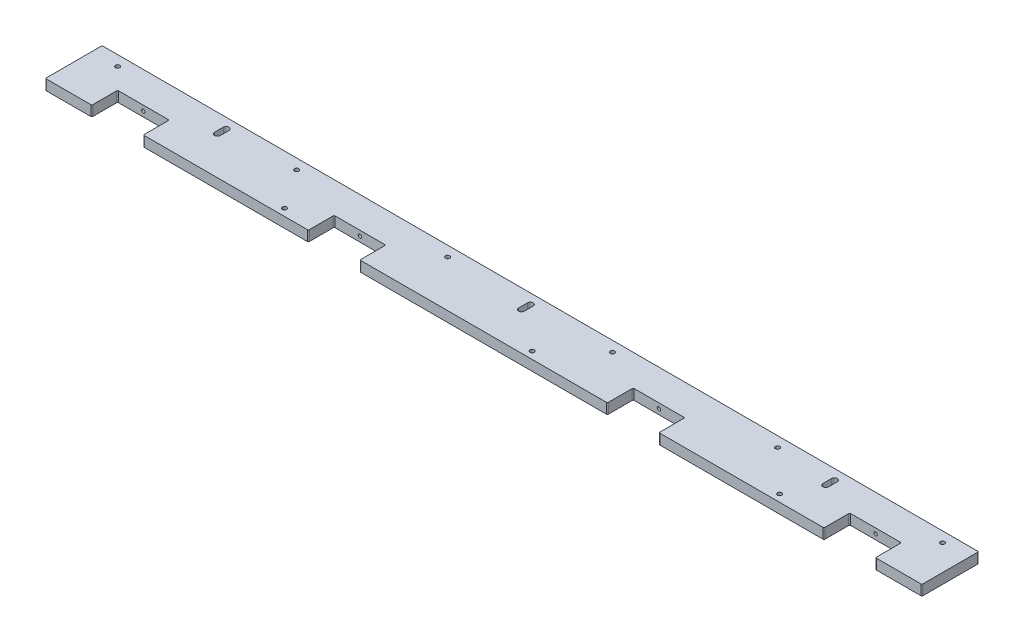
ISO-10303-21;
HEADER;
FILE_DESCRIPTION(('STEP AP214'),'2;1');
FILE_NAME('part.step','',(''),(''),'','','');
FILE_SCHEMA(('AUTOMOTIVE_DESIGN { 1 0 10303 214 1 1 1 1 }'));
ENDSEC;
DATA;
#1=APPLICATION_CONTEXT('core data for automotive mechanical design processes');
#2=APPLICATION_PROTOCOL_DEFINITION('international standard','automotive_design',2000,#1);
#3=PRODUCT_CONTEXT('',#1,'mechanical');
#4=PRODUCT('Part','Part','',(#3));
#5=PRODUCT_RELATED_PRODUCT_CATEGORY('part','',(#4));
#6=PRODUCT_DEFINITION_FORMATION('','',#4);
#7=PRODUCT_DEFINITION_CONTEXT('part definition',#1,'design');
#8=PRODUCT_DEFINITION('design','',#6,#7);
#9=PRODUCT_DEFINITION_SHAPE('','',#8);
#10=(LENGTH_UNIT() NAMED_UNIT(*) SI_UNIT(.MILLI.,.METRE.));
#11=(NAMED_UNIT(*) PLANE_ANGLE_UNIT() SI_UNIT($,.RADIAN.));
#12=(NAMED_UNIT(*) SI_UNIT($,.STERADIAN.) SOLID_ANGLE_UNIT());
#13=UNCERTAINTY_MEASURE_WITH_UNIT(LENGTH_MEASURE(1.E-05),#10,'distance_accuracy_value','');
#14=(GEOMETRIC_REPRESENTATION_CONTEXT(3) GLOBAL_UNCERTAINTY_ASSIGNED_CONTEXT((#13)) GLOBAL_UNIT_ASSIGNED_CONTEXT((#10,
#11,#12)) REPRESENTATION_CONTEXT('',''));
#15=CARTESIAN_POINT('',(0.,0.,0.));
#16=DIRECTION('',(0.,0.,1.));
#17=DIRECTION('',(1.,0.,0.));
#18=AXIS2_PLACEMENT_3D('',#15,#16,#17);
#19=CARTESIAN_POINT('',(425.,10.,27.4999999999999));
#20=DIRECTION('',(0.,0.,-1.));
#21=DIRECTION('',(-1.,0.,0.));
#22=AXIS2_PLACEMENT_3D('',#19,#20,#21);
#23=PLANE('',#22);
#24=DIRECTION('',(1.,0.,0.));
#25=VECTOR('',#24,1.);
#26=CARTESIAN_POINT('',(425.,0.,27.4999999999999));
#27=LINE('',#26,#25);
#28=CARTESIAN_POINT('',(-119.,0.,27.5));
#29=VERTEX_POINT('',#28);
#30=CARTESIAN_POINT('',(119.,0.,27.5));
#31=VERTEX_POINT('',#30);
#32=EDGE_CURVE('E764',#29,#31,#27,.T.);
#33=ORIENTED_EDGE('',*,*,#32,.T.);
#34=DIRECTION('',(0.,1.,0.));
#35=VECTOR('',#34,1.);
#36=CARTESIAN_POINT('',(119.,10.,27.5));
#37=LINE('',#36,#35);
#38=CARTESIAN_POINT('',(119.,10.,27.5));
#39=VERTEX_POINT('',#38);
#40=EDGE_CURVE('E906',#31,#39,#37,.T.);
#41=ORIENTED_EDGE('',*,*,#40,.T.);
#42=DIRECTION('',(1.,0.,0.));
#43=VECTOR('',#42,1.);
#44=CARTESIAN_POINT('',(425.,10.,27.4999999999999));
#45=LINE('',#44,#43);
#46=CARTESIAN_POINT('',(-119.,10.,27.5));
#47=VERTEX_POINT('',#46);
#48=EDGE_CURVE('E753',#47,#39,#45,.T.);
#49=ORIENTED_EDGE('',*,*,#48,.F.);
#50=DIRECTION('',(0.,-1.,0.));
#51=VECTOR('',#50,1.);
#52=CARTESIAN_POINT('',(-119.,10.,27.5));
#53=LINE('',#52,#51);
#54=EDGE_CURVE('E903',#47,#29,#53,.T.);
#55=ORIENTED_EDGE('',*,*,#54,.T.);
#56=EDGE_LOOP('',(#33,#41,#49,#55));
#57=FACE_BOUND('',#56,.T.);
#58=ADVANCED_FACE('F259',(#57),#23,.F.);
#59=CARTESIAN_POINT('',(171.,0.,27.5));
#60=VERTEX_POINT('',#59);
#61=CARTESIAN_POINT('',(329.,0.,27.5));
#62=VERTEX_POINT('',#61);
#63=EDGE_CURVE('E768',#60,#62,#27,.T.);
#64=ORIENTED_EDGE('',*,*,#63,.T.);
#65=DIRECTION('',(0.,1.,0.));
#66=VECTOR('',#65,1.);
#67=CARTESIAN_POINT('',(329.,10.,27.5));
#68=LINE('',#67,#66);
#69=CARTESIAN_POINT('',(329.,10.,27.5));
#70=VERTEX_POINT('',#69);
#71=EDGE_CURVE('E881',#62,#70,#68,.T.);
#72=ORIENTED_EDGE('',*,*,#71,.T.);
#73=CARTESIAN_POINT('',(171.,10.,27.5));
#74=VERTEX_POINT('',#73);
#75=EDGE_CURVE('E1154',#74,#70,#45,.T.);
#76=ORIENTED_EDGE('',*,*,#75,.F.);
#77=DIRECTION('',(0.,-1.,0.));
#78=VECTOR('',#77,1.);
#79=CARTESIAN_POINT('',(171.,10.,27.5));
#80=LINE('',#79,#78);
#81=EDGE_CURVE('E878',#74,#60,#80,.T.);
#82=ORIENTED_EDGE('',*,*,#81,.T.);
#83=EDGE_LOOP('',(#64,#72,#76,#82));
#84=FACE_BOUND('',#83,.T.);
#85=ADVANCED_FACE('F1042',(#84),#23,.F.);
#86=CARTESIAN_POINT('',(381.,0.,27.5));
#87=VERTEX_POINT('',#86);
#88=CARTESIAN_POINT('',(424.,0.,27.4999999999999));
#89=VERTEX_POINT('',#88);
#90=EDGE_CURVE('E763',#87,#89,#27,.T.);
#91=ORIENTED_EDGE('',*,*,#90,.T.);
#92=DIRECTION('',(0.,-1.,0.));
#93=VECTOR('',#92,1.);
#94=CARTESIAN_POINT('',(424.,10.,27.4999999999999));
#95=LINE('',#94,#93);
#96=CARTESIAN_POINT('',(424.,10.,27.4999999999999));
#97=VERTEX_POINT('',#96);
#98=EDGE_CURVE('E887',#89,#97,#95,.F.);
#99=ORIENTED_EDGE('',*,*,#98,.T.);
#100=CARTESIAN_POINT('',(381.,10.,27.5));
#101=VERTEX_POINT('',#100);
#102=EDGE_CURVE('E748',#101,#97,#45,.T.);
#103=ORIENTED_EDGE('',*,*,#102,.F.);
#104=DIRECTION('',(0.,-1.,0.));
#105=VECTOR('',#104,1.);
#106=CARTESIAN_POINT('',(381.,10.,27.5));
#107=LINE('',#106,#105);
#108=EDGE_CURVE('E884',#101,#87,#107,.T.);
#109=ORIENTED_EDGE('',*,*,#108,.T.);
#110=EDGE_LOOP('',(#91,#99,#103,#109));
#111=FACE_BOUND('',#110,.T.);
#112=ADVANCED_FACE('F1049',(#111),#23,.F.);
#113=CARTESIAN_POINT('',(-329.,0.,27.5));
#114=VERTEX_POINT('',#113);
#115=CARTESIAN_POINT('',(-171.,0.,27.5));
#116=VERTEX_POINT('',#115);
#117=EDGE_CURVE('E767',#114,#116,#27,.T.);
#118=ORIENTED_EDGE('',*,*,#117,.T.);
#119=DIRECTION('',(0.,1.,0.));
#120=VECTOR('',#119,1.);
#121=CARTESIAN_POINT('',(-171.,10.,27.5));
#122=LINE('',#121,#120);
#123=CARTESIAN_POINT('',(-171.,10.,27.5));
#124=VERTEX_POINT('',#123);
#125=EDGE_CURVE('E925',#116,#124,#122,.T.);
#126=ORIENTED_EDGE('',*,*,#125,.T.);
#127=CARTESIAN_POINT('',(-329.,10.,27.5));
#128=VERTEX_POINT('',#127);
#129=EDGE_CURVE('E750',#128,#124,#45,.T.);
#130=ORIENTED_EDGE('',*,*,#129,.F.);
#131=DIRECTION('',(0.,-1.,0.));
#132=VECTOR('',#131,1.);
#133=CARTESIAN_POINT('',(-329.,10.,27.5));
#134=LINE('',#133,#132);
#135=EDGE_CURVE('E922',#128,#114,#134,.T.);
#136=ORIENTED_EDGE('',*,*,#135,.T.);
#137=EDGE_LOOP('',(#118,#126,#130,#136));
#138=FACE_BOUND('',#137,.T.);
#139=ADVANCED_FACE('F1057',(#138),#23,.F.);
#140=CARTESIAN_POINT('',(-425.,10.,-27.4999999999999));
#141=DIRECTION('',(1.,0.,0.));
#142=DIRECTION('',(0.,0.,-1.));
#143=AXIS2_PLACEMENT_3D('',#140,#141,#142);
#144=PLANE('',#143);
#145=DIRECTION('',(0.,0.,1.));
#146=VECTOR('',#145,1.);
#147=CARTESIAN_POINT('',(-425.,10.,-27.4999999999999));
#148=LINE('',#147,#146);
#149=CARTESIAN_POINT('',(-425.,10.,-26.4999999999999));
#150=VERTEX_POINT('',#149);
#151=CARTESIAN_POINT('',(-425.,10.,26.5));
#152=VERTEX_POINT('',#151);
#153=EDGE_CURVE('E745',#150,#152,#148,.T.);
#154=ORIENTED_EDGE('',*,*,#153,.F.);
#155=DIRECTION('',(0.,-1.,0.));
#156=VECTOR('',#155,1.);
#157=CARTESIAN_POINT('',(-425.,10.,-26.4999999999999));
#158=LINE('',#157,#156);
#159=CARTESIAN_POINT('',(-425.,0.,-26.4999999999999));
#160=VERTEX_POINT('',#159);
#161=EDGE_CURVE('E804',#150,#160,#158,.T.);
#162=ORIENTED_EDGE('',*,*,#161,.T.);
#163=DIRECTION('',(0.,0.,1.));
#164=VECTOR('',#163,1.);
#165=CARTESIAN_POINT('',(-425.,0.,-27.4999999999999));
#166=LINE('',#165,#164);
#167=CARTESIAN_POINT('',(-425.,0.,26.5));
#168=VERTEX_POINT('',#167);
#169=EDGE_CURVE('E744',#160,#168,#166,.T.);
#170=ORIENTED_EDGE('',*,*,#169,.T.);
#171=DIRECTION('',(0.,-1.,0.));
#172=VECTOR('',#171,1.);
#173=CARTESIAN_POINT('',(-425.,10.,26.5));
#174=LINE('',#173,#172);
#175=EDGE_CURVE('E802',#168,#152,#174,.F.);
#176=ORIENTED_EDGE('',*,*,#175,.T.);
#177=EDGE_LOOP('',(#154,#162,#170,#176));
#178=FACE_BOUND('',#177,.T.);
#179=ADVANCED_FACE('F1055',(#178),#144,.F.);
#180=CARTESIAN_POINT('',(-424.,10.,27.5000000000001));
#181=VERTEX_POINT('',#180);
#182=CARTESIAN_POINT('',(-381.,10.,27.5));
#183=VERTEX_POINT('',#182);
#184=EDGE_CURVE('E752',#181,#183,#45,.T.);
#185=ORIENTED_EDGE('',*,*,#184,.F.);
#186=DIRECTION('',(0.,-1.,0.));
#187=VECTOR('',#186,1.);
#188=CARTESIAN_POINT('',(-424.,10.,27.5000000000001));
#189=LINE('',#188,#187);
#190=CARTESIAN_POINT('',(-424.,0.,27.5000000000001));
#191=VERTEX_POINT('',#190);
#192=EDGE_CURVE('E931',#181,#191,#189,.T.);
#193=ORIENTED_EDGE('',*,*,#192,.T.);
#194=CARTESIAN_POINT('',(-381.,0.,27.5));
#195=VERTEX_POINT('',#194);
#196=EDGE_CURVE('E772',#191,#195,#27,.T.);
#197=ORIENTED_EDGE('',*,*,#196,.T.);
#198=DIRECTION('',(0.,1.,0.));
#199=VECTOR('',#198,1.);
#200=CARTESIAN_POINT('',(-381.,10.,27.5));
#201=LINE('',#200,#199);
#202=EDGE_CURVE('E928',#195,#183,#201,.T.);
#203=ORIENTED_EDGE('',*,*,#202,.T.);
#204=EDGE_LOOP('',(#185,#193,#197,#203));
#205=FACE_BOUND('',#204,.T.);
#206=ADVANCED_FACE('F1045',(#205),#23,.F.);
#207=CARTESIAN_POINT('',(425.,10.,-27.5000000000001));
#208=DIRECTION('',(-1.,0.,0.));
#209=DIRECTION('',(0.,0.,1.));
#210=AXIS2_PLACEMENT_3D('',#207,#208,#209);
#211=PLANE('',#210);
#212=DIRECTION('',(0.,0.,-1.));
#213=VECTOR('',#212,1.);
#214=CARTESIAN_POINT('',(425.,0.,-27.5000000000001));
#215=LINE('',#214,#213);
#216=CARTESIAN_POINT('',(425.,0.,26.5));
#217=VERTEX_POINT('',#216);
#218=CARTESIAN_POINT('',(425.,0.,-26.5000000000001));
#219=VERTEX_POINT('',#218);
#220=EDGE_CURVE('E769',#217,#219,#215,.T.);
#221=ORIENTED_EDGE('',*,*,#220,.T.);
#222=DIRECTION('',(0.,-1.,0.));
#223=VECTOR('',#222,1.);
#224=CARTESIAN_POINT('',(425.,10.,-26.5000000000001));
#225=LINE('',#224,#223);
#226=CARTESIAN_POINT('',(425.,10.,-26.5000000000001));
#227=VERTEX_POINT('',#226);
#228=EDGE_CURVE('E862',#219,#227,#225,.F.);
#229=ORIENTED_EDGE('',*,*,#228,.T.);
#230=DIRECTION('',(0.,0.,-1.));
#231=VECTOR('',#230,1.);
#232=CARTESIAN_POINT('',(425.,10.,-27.5000000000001));
#233=LINE('',#232,#231);
#234=CARTESIAN_POINT('',(425.,10.,26.5));
#235=VERTEX_POINT('',#234);
#236=EDGE_CURVE('E754',#235,#227,#233,.T.);
#237=ORIENTED_EDGE('',*,*,#236,.F.);
#238=DIRECTION('',(0.,-1.,0.));
#239=VECTOR('',#238,1.);
#240=CARTESIAN_POINT('',(425.,10.,26.5));
#241=LINE('',#240,#239);
#242=EDGE_CURVE('E859',#235,#217,#241,.T.);
#243=ORIENTED_EDGE('',*,*,#242,.T.);
#244=EDGE_LOOP('',(#221,#229,#237,#243));
#245=FACE_BOUND('',#244,.T.);
#246=ADVANCED_FACE('F1054',(#245),#211,.F.);
#247=CARTESIAN_POINT('',(425.,10.,-27.5000000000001));
#248=DIRECTION('',(0.,0.,1.));
#249=DIRECTION('',(1.,0.,0.));
#250=AXIS2_PLACEMENT_3D('',#247,#248,#249);
#251=PLANE('',#250);
#252=CARTESIAN_POINT('',(-355.,5.,-27.5000000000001));
#253=DIRECTION('',(0.,0.,1.));
#254=DIRECTION('',(1.,0.,0.));
#255=AXIS2_PLACEMENT_3D('',#252,#253,#254);
#256=CIRCLE('',#255,1.64999999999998);
#257=CARTESIAN_POINT('',(-353.35,5.,-27.5000000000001));
#258=VERTEX_POINT('',#257);
#259=EDGE_CURVE('E778',#258,#258,#256,.T.);
#260=ORIENTED_EDGE('',*,*,#259,.T.);
#261=EDGE_LOOP('',(#260));
#262=FACE_BOUND('',#261,.T.);
#263=CARTESIAN_POINT('',(145.,5.,-27.5000000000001));
#264=DIRECTION('',(0.,0.,1.));
#265=DIRECTION('',(1.,0.,0.));
#266=AXIS2_PLACEMENT_3D('',#263,#264,#265);
#267=CIRCLE('',#266,1.64999999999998);
#268=CARTESIAN_POINT('',(146.65,5.,-27.5000000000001));
#269=VERTEX_POINT('',#268);
#270=EDGE_CURVE('E1010',#269,#269,#267,.T.);
#271=ORIENTED_EDGE('',*,*,#270,.T.);
#272=EDGE_LOOP('',(#271));
#273=FACE_BOUND('',#272,.T.);
#274=CARTESIAN_POINT('',(355.,5.,-27.5000000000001));
#275=DIRECTION('',(0.,0.,1.));
#276=DIRECTION('',(1.,0.,0.));
#277=AXIS2_PLACEMENT_3D('',#274,#275,#276);
#278=CIRCLE('',#277,1.64999999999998);
#279=CARTESIAN_POINT('',(356.65,5.,-27.5000000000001));
#280=VERTEX_POINT('',#279);
#281=EDGE_CURVE('E1013',#280,#280,#278,.T.);
#282=ORIENTED_EDGE('',*,*,#281,.T.);
#283=EDGE_LOOP('',(#282));
#284=FACE_BOUND('',#283,.T.);
#285=CARTESIAN_POINT('',(-145.,5.,-27.5000000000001));
#286=DIRECTION('',(0.,0.,1.));
#287=DIRECTION('',(1.,0.,0.));
#288=AXIS2_PLACEMENT_3D('',#285,#286,#287);
#289=CIRCLE('',#288,1.64999999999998);
#290=CARTESIAN_POINT('',(-143.35,5.,-27.5000000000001));
#291=VERTEX_POINT('',#290);
#292=EDGE_CURVE('E1016',#291,#291,#289,.T.);
#293=ORIENTED_EDGE('',*,*,#292,.T.);
#294=EDGE_LOOP('',(#293));
#295=FACE_BOUND('',#294,.T.);
#296=DIRECTION('',(-1.,0.,0.));
#297=VECTOR('',#296,1.);
#298=CARTESIAN_POINT('',(425.,0.,-27.5000000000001));
#299=LINE('',#298,#297);
#300=CARTESIAN_POINT('',(424.,0.,-27.5000000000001));
#301=VERTEX_POINT('',#300);
#302=CARTESIAN_POINT('',(-424.,0.,-27.4999999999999));
#303=VERTEX_POINT('',#302);
#304=EDGE_CURVE('E749',#301,#303,#299,.T.);
#305=ORIENTED_EDGE('',*,*,#304,.T.);
#306=DIRECTION('',(0.,-1.,0.));
#307=VECTOR('',#306,1.);
#308=CARTESIAN_POINT('',(-424.,10.,-27.4999999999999));
#309=LINE('',#308,#307);
#310=CARTESIAN_POINT('',(-424.,10.,-27.4999999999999));
#311=VERTEX_POINT('',#310);
#312=EDGE_CURVE('E834',#303,#311,#309,.F.);
#313=ORIENTED_EDGE('',*,*,#312,.T.);
#314=DIRECTION('',(-1.,0.,0.));
#315=VECTOR('',#314,1.);
#316=CARTESIAN_POINT('',(425.,10.,-27.5000000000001));
#317=LINE('',#316,#315);
#318=CARTESIAN_POINT('',(424.,10.,-27.5000000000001));
#319=VERTEX_POINT('',#318);
#320=EDGE_CURVE('E757',#319,#311,#317,.T.);
#321=ORIENTED_EDGE('',*,*,#320,.F.);
#322=DIRECTION('',(0.,-1.,0.));
#323=VECTOR('',#322,1.);
#324=CARTESIAN_POINT('',(424.,10.,-27.5000000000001));
#325=LINE('',#324,#323);
#326=EDGE_CURVE('E831',#319,#301,#325,.T.);
#327=ORIENTED_EDGE('',*,*,#326,.T.);
#328=EDGE_LOOP('',(#305,#313,#321,#327));
#329=FACE_BOUND('',#328,.T.);
#330=ADVANCED_FACE('F1062',(#262,#273,#284,#295,#329),#251,.F.);
#331=CARTESIAN_POINT('',(0.,10.,0.));
#332=DIRECTION('',(0.,-1.,0.));
#333=DIRECTION('',(0.,0.,-1.));
#334=AXIS2_PLACEMENT_3D('',#331,#332,#333);
#335=PLANE('',#334);
#336=DIRECTION('',(0.,0.,-1.));
#337=VECTOR('',#336,1.);
#338=CARTESIAN_POINT('',(-297.749999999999,10.,-9.25000000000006));
#339=LINE('',#338,#337);
#340=CARTESIAN_POINT('',(-297.749999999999,10.,-9.25000000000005));
#341=VERTEX_POINT('',#340);
#342=CARTESIAN_POINT('',(-297.749999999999,10.,-17.7500000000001));
#343=VERTEX_POINT('',#342);
#344=EDGE_CURVE('E611',#341,#343,#339,.T.);
#345=ORIENTED_EDGE('',*,*,#344,.T.);
#346=CARTESIAN_POINT('',(-294.999999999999,10.,-17.7500000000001));
#347=DIRECTION('',(0.,1.,0.));
#348=DIRECTION('',(0.,0.,1.));
#349=AXIS2_PLACEMENT_3D('',#346,#347,#348);
#350=CIRCLE('',#349,2.74999999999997);
#351=CARTESIAN_POINT('',(-292.249999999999,10.,-17.7500000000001));
#352=VERTEX_POINT('',#351);
#353=EDGE_CURVE('E621',#352,#343,#350,.T.);
#354=ORIENTED_EDGE('',*,*,#353,.F.);
#355=DIRECTION('',(0.,0.,-1.));
#356=VECTOR('',#355,1.);
#357=CARTESIAN_POINT('',(-292.249999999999,10.,-9.25000000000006));
#358=LINE('',#357,#356);
#359=CARTESIAN_POINT('',(-292.249999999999,10.,-9.25000000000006));
#360=VERTEX_POINT('',#359);
#361=EDGE_CURVE('E600',#360,#352,#358,.T.);
#362=ORIENTED_EDGE('',*,*,#361,.F.);
#363=CARTESIAN_POINT('',(-294.999999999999,10.,-9.25000000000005));
#364=DIRECTION('',(0.,1.,0.));
#365=DIRECTION('',(0.,0.,1.));
#366=AXIS2_PLACEMENT_3D('',#363,#364,#365);
#367=CIRCLE('',#366,2.74999999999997);
#368=EDGE_CURVE('E609',#341,#360,#367,.T.);
#369=ORIENTED_EDGE('',*,*,#368,.F.);
#370=EDGE_LOOP('',(#345,#354,#362,#369));
#371=FACE_BOUND('',#370,.T.);
#372=CARTESIAN_POINT('',(7.21644966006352E-13,10.,-9.25000000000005));
#373=DIRECTION('',(0.,1.,0.));
#374=DIRECTION('',(0.,0.,1.));
#375=AXIS2_PLACEMENT_3D('',#372,#373,#374);
#376=CIRCLE('',#375,2.75);
#377=CARTESIAN_POINT('',(-2.74999999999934,10.,-9.25000000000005));
#378=VERTEX_POINT('',#377);
#379=CARTESIAN_POINT('',(2.75000000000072,10.,-9.25000000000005));
#380=VERTEX_POINT('',#379);
#381=EDGE_CURVE('E641',#378,#380,#376,.T.);
#382=ORIENTED_EDGE('',*,*,#381,.F.);
#383=DIRECTION('',(0.,0.,-1.));
#384=VECTOR('',#383,1.);
#385=CARTESIAN_POINT('',(-2.74999999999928,10.,-9.25000000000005));
#386=LINE('',#385,#384);
#387=CARTESIAN_POINT('',(-2.74999999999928,10.,-17.7500000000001));
#388=VERTEX_POINT('',#387);
#389=EDGE_CURVE('E635',#378,#388,#386,.T.);
#390=ORIENTED_EDGE('',*,*,#389,.T.);
#391=CARTESIAN_POINT('',(7.21644966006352E-13,10.,-17.7500000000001));
#392=DIRECTION('',(0.,1.,0.));
#393=DIRECTION('',(0.,0.,1.));
#394=AXIS2_PLACEMENT_3D('',#391,#392,#393);
#395=CIRCLE('',#394,2.75);
#396=CARTESIAN_POINT('',(2.75000000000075,10.,-17.75));
#397=VERTEX_POINT('',#396);
#398=EDGE_CURVE('E651',#397,#388,#395,.T.);
#399=ORIENTED_EDGE('',*,*,#398,.F.);
#400=DIRECTION('',(0.,0.,-1.));
#401=VECTOR('',#400,1.);
#402=CARTESIAN_POINT('',(2.75000000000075,10.,-9.25000000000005));
#403=LINE('',#402,#401);
#404=EDGE_CURVE('E628',#380,#397,#403,.T.);
#405=ORIENTED_EDGE('',*,*,#404,.F.);
#406=EDGE_LOOP('',(#382,#390,#399,#405));
#407=FACE_BOUND('',#406,.T.);
#408=CARTESIAN_POINT('',(295.000000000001,10.,-9.25000000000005));
#409=DIRECTION('',(0.,1.,0.));
#410=DIRECTION('',(0.,0.,1.));
#411=AXIS2_PLACEMENT_3D('',#408,#409,#410);
#412=CIRCLE('',#411,2.74999999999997);
#413=CARTESIAN_POINT('',(292.250000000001,10.,-9.25000000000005));
#414=VERTEX_POINT('',#413);
#415=CARTESIAN_POINT('',(297.750000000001,10.,-9.25000000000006));
#416=VERTEX_POINT('',#415);
#417=EDGE_CURVE('E672',#414,#416,#412,.T.);
#418=ORIENTED_EDGE('',*,*,#417,.F.);
#419=DIRECTION('',(0.,0.,-1.));
#420=VECTOR('',#419,1.);
#421=CARTESIAN_POINT('',(292.250000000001,10.,-9.25000000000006));
#422=LINE('',#421,#420);
#423=CARTESIAN_POINT('',(292.250000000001,10.,-17.7500000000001));
#424=VERTEX_POINT('',#423);
#425=EDGE_CURVE('E666',#414,#424,#422,.T.);
#426=ORIENTED_EDGE('',*,*,#425,.T.);
#427=CARTESIAN_POINT('',(295.000000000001,10.,-17.7500000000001));
#428=DIRECTION('',(0.,1.,0.));
#429=DIRECTION('',(0.,0.,1.));
#430=AXIS2_PLACEMENT_3D('',#427,#428,#429);
#431=CIRCLE('',#430,2.74999999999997);
#432=CARTESIAN_POINT('',(297.750000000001,10.,-17.7500000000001));
#433=VERTEX_POINT('',#432);
#434=EDGE_CURVE('E682',#433,#424,#431,.T.);
#435=ORIENTED_EDGE('',*,*,#434,.F.);
#436=DIRECTION('',(0.,0.,-1.));
#437=VECTOR('',#436,1.);
#438=CARTESIAN_POINT('',(297.750000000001,10.,-9.25000000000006));
#439=LINE('',#438,#437);
#440=EDGE_CURVE('E659',#416,#433,#439,.T.);
#441=ORIENTED_EDGE('',*,*,#440,.F.);
#442=EDGE_LOOP('',(#418,#426,#435,#441));
#443=FACE_BOUND('',#442,.T.);
#444=CARTESIAN_POINT('',(-226.3,10.,-17.5000000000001));
#445=DIRECTION('',(0.,1.,0.));
#446=DIRECTION('',(0.,0.,1.));
#447=AXIS2_PLACEMENT_3D('',#444,#445,#446);
#448=CIRCLE('',#447,2.09999999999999);
#449=CARTESIAN_POINT('',(-226.3,10.,-15.4000000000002));
#450=VERTEX_POINT('',#449);
#451=EDGE_CURVE('E690',#450,#450,#448,.T.);
#452=ORIENTED_EDGE('',*,*,#451,.F.);
#453=EDGE_LOOP('',(#452));
#454=FACE_BOUND('',#453,.T.);
#455=CARTESIAN_POINT('',(-79.9999999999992,10.,-17.5000000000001));
#456=DIRECTION('',(0.,1.,0.));
#457=DIRECTION('',(0.,0.,1.));
#458=AXIS2_PLACEMENT_3D('',#455,#456,#457);
#459=CIRCLE('',#458,2.1);
#460=CARTESIAN_POINT('',(-79.9999999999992,10.,-15.4000000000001));
#461=VERTEX_POINT('',#460);
#462=EDGE_CURVE('E696',#461,#461,#459,.T.);
#463=ORIENTED_EDGE('',*,*,#462,.F.);
#464=EDGE_LOOP('',(#463));
#465=FACE_BOUND('',#464,.T.);
#466=CARTESIAN_POINT('',(80.0000000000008,10.,-17.5000000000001));
#467=DIRECTION('',(0.,1.,0.));
#468=DIRECTION('',(0.,0.,1.));
#469=AXIS2_PLACEMENT_3D('',#466,#467,#468);
#470=CIRCLE('',#469,2.1);
#471=CARTESIAN_POINT('',(80.0000000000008,10.,-15.4000000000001));
#472=VERTEX_POINT('',#471);
#473=EDGE_CURVE('E702',#472,#472,#470,.T.);
#474=ORIENTED_EDGE('',*,*,#473,.F.);
#475=EDGE_LOOP('',(#474));
#476=FACE_BOUND('',#475,.T.);
#477=CARTESIAN_POINT('',(240.000000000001,10.,-17.5000000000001));
#478=DIRECTION('',(0.,1.,0.));
#479=DIRECTION('',(0.,0.,1.));
#480=AXIS2_PLACEMENT_3D('',#477,#478,#479);
#481=CIRCLE('',#480,2.09999999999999);
#482=CARTESIAN_POINT('',(240.000000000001,10.,-15.4000000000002));
#483=VERTEX_POINT('',#482);
#484=EDGE_CURVE('E708',#483,#483,#481,.T.);
#485=ORIENTED_EDGE('',*,*,#484,.F.);
#486=EDGE_LOOP('',(#485));
#487=FACE_BOUND('',#486,.T.);
#488=CARTESIAN_POINT('',(400.000000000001,10.,-17.5000000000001));
#489=DIRECTION('',(0.,1.,0.));
#490=DIRECTION('',(0.,0.,1.));
#491=AXIS2_PLACEMENT_3D('',#488,#489,#490);
#492=CIRCLE('',#491,2.09999999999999);
#493=CARTESIAN_POINT('',(400.000000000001,10.,-15.4000000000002));
#494=VERTEX_POINT('',#493);
#495=EDGE_CURVE('E714',#494,#494,#492,.T.);
#496=ORIENTED_EDGE('',*,*,#495,.F.);
#497=EDGE_LOOP('',(#496));
#498=FACE_BOUND('',#497,.T.);
#499=CARTESIAN_POINT('',(-399.999999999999,10.,-17.5000000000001));
#500=DIRECTION('',(0.,1.,0.));
#501=DIRECTION('',(0.,0.,1.));
#502=AXIS2_PLACEMENT_3D('',#499,#500,#501);
#503=CIRCLE('',#502,2.09999999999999);
#504=CARTESIAN_POINT('',(-399.999999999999,10.,-15.4000000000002));
#505=VERTEX_POINT('',#504);
#506=EDGE_CURVE('E720',#505,#505,#503,.T.);
#507=ORIENTED_EDGE('',*,*,#506,.F.);
#508=EDGE_LOOP('',(#507));
#509=FACE_BOUND('',#508,.T.);
#510=CARTESIAN_POINT('',(40.0000000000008,10.,20.5000000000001));
#511=DIRECTION('',(0.,1.,0.));
#512=DIRECTION('',(0.,0.,1.));
#513=AXIS2_PLACEMENT_3D('',#510,#511,#512);
#514=CIRCLE('',#513,2.1);
#515=CARTESIAN_POINT('',(40.0000000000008,10.,22.6000000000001));
#516=VERTEX_POINT('',#515);
#517=EDGE_CURVE('E726',#516,#516,#514,.T.);
#518=ORIENTED_EDGE('',*,*,#517,.F.);
#519=EDGE_LOOP('',(#518));
#520=FACE_BOUND('',#519,.T.);
#521=CARTESIAN_POINT('',(280.000000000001,10.,20.5000000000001));
#522=DIRECTION('',(0.,1.,0.));
#523=DIRECTION('',(0.,0.,1.));
#524=AXIS2_PLACEMENT_3D('',#521,#522,#523);
#525=CIRCLE('',#524,2.09999999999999);
#526=CARTESIAN_POINT('',(280.000000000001,10.,22.6));
#527=VERTEX_POINT('',#526);
#528=EDGE_CURVE('E732',#527,#527,#525,.T.);
#529=ORIENTED_EDGE('',*,*,#528,.F.);
#530=EDGE_LOOP('',(#529));
#531=FACE_BOUND('',#530,.T.);
#532=CARTESIAN_POINT('',(-199.999999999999,10.,20.5000000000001));
#533=DIRECTION('',(0.,1.,0.));
#534=DIRECTION('',(0.,0.,1.));
#535=AXIS2_PLACEMENT_3D('',#532,#533,#534);
#536=CIRCLE('',#535,2.09999999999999);
#537=CARTESIAN_POINT('',(-199.999999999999,10.,22.6));
#538=VERTEX_POINT('',#537);
#539=EDGE_CURVE('E738',#538,#538,#536,.T.);
#540=ORIENTED_EDGE('',*,*,#539,.F.);
#541=EDGE_LOOP('',(#540));
#542=FACE_BOUND('',#541,.T.);
#543=ORIENTED_EDGE('',*,*,#320,.T.);
#544=CARTESIAN_POINT('',(-424.,10.,-26.4999999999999));
#545=DIRECTION('',(0.,-1.,0.));
#546=DIRECTION('',(0.,0.,-1.));
#547=AXIS2_PLACEMENT_3D('',#544,#545,#546);
#548=CIRCLE('',#547,1.);
#549=EDGE_CURVE('E857',#311,#150,#548,.F.);
#550=ORIENTED_EDGE('',*,*,#549,.T.);
#551=ORIENTED_EDGE('',*,*,#153,.T.);
#552=CARTESIAN_POINT('',(-424.,10.,26.5));
#553=DIRECTION('',(0.,-1.,0.));
#554=DIRECTION('',(0.,0.,-1.));
#555=AXIS2_PLACEMENT_3D('',#552,#553,#554);
#556=CIRCLE('',#555,1.);
#557=EDGE_CURVE('E840',#152,#181,#556,.F.);
#558=ORIENTED_EDGE('',*,*,#557,.T.);
#559=ORIENTED_EDGE('',*,*,#184,.T.);
#560=CARTESIAN_POINT('',(-381.,10.,26.5));
#561=DIRECTION('',(0.,-1.,0.));
#562=DIRECTION('',(0.,0.,-1.));
#563=AXIS2_PLACEMENT_3D('',#560,#561,#562);
#564=CIRCLE('',#563,1.);
#565=CARTESIAN_POINT('',(-380.,10.,26.5));
#566=VERTEX_POINT('',#565);
#567=EDGE_CURVE('E838',#183,#566,#564,.F.);
#568=ORIENTED_EDGE('',*,*,#567,.T.);
#569=DIRECTION('',(0.,0.,1.));
#570=VECTOR('',#569,1.);
#571=CARTESIAN_POINT('',(-380.,10.,52.5));
#572=LINE('',#571,#570);
#573=CARTESIAN_POINT('',(-380.,10.,3.50000000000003));
#574=VERTEX_POINT('',#573);
#575=EDGE_CURVE('E980',#574,#566,#572,.T.);
#576=ORIENTED_EDGE('',*,*,#575,.F.);
#577=CARTESIAN_POINT('',(-379.,10.,3.50000000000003));
#578=DIRECTION('',(0.,-1.,0.));
#579=DIRECTION('',(0.,0.,-1.));
#580=AXIS2_PLACEMENT_3D('',#577,#578,#579);
#581=CIRCLE('',#580,1.);
#582=CARTESIAN_POINT('',(-379.,10.,2.50000000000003));
#583=VERTEX_POINT('',#582);
#584=EDGE_CURVE('E267',#574,#583,#581,.T.);
#585=ORIENTED_EDGE('',*,*,#584,.T.);
#586=DIRECTION('',(-1.,0.,0.));
#587=VECTOR('',#586,1.);
#588=CARTESIAN_POINT('',(-380.,10.,2.50000000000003));
#589=LINE('',#588,#587);
#590=CARTESIAN_POINT('',(-331.,10.,2.50000000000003));
#591=VERTEX_POINT('',#590);
#592=EDGE_CURVE('E978',#591,#583,#589,.T.);
#593=ORIENTED_EDGE('',*,*,#592,.F.);
#594=CARTESIAN_POINT('',(-331.,10.,3.50000000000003));
#595=DIRECTION('',(0.,-1.,0.));
#596=DIRECTION('',(0.,0.,-1.));
#597=AXIS2_PLACEMENT_3D('',#594,#595,#596);
#598=CIRCLE('',#597,1.);
#599=CARTESIAN_POINT('',(-330.,10.,3.50000000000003));
#600=VERTEX_POINT('',#599);
#601=EDGE_CURVE('E971',#591,#600,#598,.T.);
#602=ORIENTED_EDGE('',*,*,#601,.T.);
#603=DIRECTION('',(0.,0.,-1.));
#604=VECTOR('',#603,1.);
#605=CARTESIAN_POINT('',(-330.,10.,52.5));
#606=LINE('',#605,#604);
#607=CARTESIAN_POINT('',(-330.,10.,26.5));
#608=VERTEX_POINT('',#607);
#609=EDGE_CURVE('E793',#608,#600,#606,.T.);
#610=ORIENTED_EDGE('',*,*,#609,.F.);
#611=CARTESIAN_POINT('',(-329.,10.,26.5));
#612=DIRECTION('',(0.,-1.,0.));
#613=DIRECTION('',(0.,0.,-1.));
#614=AXIS2_PLACEMENT_3D('',#611,#612,#613);
#615=CIRCLE('',#614,1.);
#616=EDGE_CURVE('E836',#608,#128,#615,.F.);
#617=ORIENTED_EDGE('',*,*,#616,.T.);
#618=ORIENTED_EDGE('',*,*,#129,.T.);
#619=CARTESIAN_POINT('',(-171.,10.,26.5));
#620=DIRECTION('',(0.,-1.,0.));
#621=DIRECTION('',(0.,0.,-1.));
#622=AXIS2_PLACEMENT_3D('',#619,#620,#621);
#623=CIRCLE('',#622,1.);
#624=CARTESIAN_POINT('',(-170.,10.,26.5));
#625=VERTEX_POINT('',#624);
#626=EDGE_CURVE('E274',#124,#625,#623,.F.);
#627=ORIENTED_EDGE('',*,*,#626,.T.);
#628=DIRECTION('',(0.,0.,1.));
#629=VECTOR('',#628,1.);
#630=CARTESIAN_POINT('',(-170.,10.,52.5));
#631=LINE('',#630,#629);
#632=CARTESIAN_POINT('',(-170.,10.,3.50000000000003));
#633=VERTEX_POINT('',#632);
#634=EDGE_CURVE('E1085',#633,#625,#631,.T.);
#635=ORIENTED_EDGE('',*,*,#634,.F.);
#636=CARTESIAN_POINT('',(-169.,10.,3.50000000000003));
#637=DIRECTION('',(0.,-1.,0.));
#638=DIRECTION('',(0.,0.,-1.));
#639=AXIS2_PLACEMENT_3D('',#636,#637,#638);
#640=CIRCLE('',#639,1.);
#641=CARTESIAN_POINT('',(-169.,10.,2.50000000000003));
#642=VERTEX_POINT('',#641);
#643=EDGE_CURVE('E282',#633,#642,#640,.T.);
#644=ORIENTED_EDGE('',*,*,#643,.T.);
#645=DIRECTION('',(-1.,0.,0.));
#646=VECTOR('',#645,1.);
#647=CARTESIAN_POINT('',(-170.,10.,2.50000000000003));
#648=LINE('',#647,#646);
#649=CARTESIAN_POINT('',(-121.,10.,2.50000000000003));
#650=VERTEX_POINT('',#649);
#651=EDGE_CURVE('E1095',#650,#642,#648,.T.);
#652=ORIENTED_EDGE('',*,*,#651,.F.);
#653=CARTESIAN_POINT('',(-121.,10.,3.50000000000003));
#654=DIRECTION('',(0.,-1.,0.));
#655=DIRECTION('',(0.,0.,-1.));
#656=AXIS2_PLACEMENT_3D('',#653,#654,#655);
#657=CIRCLE('',#656,1.);
#658=CARTESIAN_POINT('',(-120.,10.,3.50000000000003));
#659=VERTEX_POINT('',#658);
#660=EDGE_CURVE('E964',#650,#659,#657,.T.);
#661=ORIENTED_EDGE('',*,*,#660,.T.);
#662=DIRECTION('',(0.,0.,-1.));
#663=VECTOR('',#662,1.);
#664=CARTESIAN_POINT('',(-120.,10.,52.5));
#665=LINE('',#664,#663);
#666=CARTESIAN_POINT('',(-120.,10.,26.5));
#667=VERTEX_POINT('',#666);
#668=EDGE_CURVE('E1092',#667,#659,#665,.T.);
#669=ORIENTED_EDGE('',*,*,#668,.F.);
#670=CARTESIAN_POINT('',(-119.,10.,26.5));
#671=DIRECTION('',(0.,-1.,0.));
#672=DIRECTION('',(0.,0.,-1.));
#673=AXIS2_PLACEMENT_3D('',#670,#671,#672);
#674=CIRCLE('',#673,1.);
#675=EDGE_CURVE('E843',#667,#47,#674,.F.);
#676=ORIENTED_EDGE('',*,*,#675,.T.);
#677=ORIENTED_EDGE('',*,*,#48,.T.);
#678=CARTESIAN_POINT('',(119.,10.,26.5));
#679=DIRECTION('',(0.,-1.,0.));
#680=DIRECTION('',(0.,0.,-1.));
#681=AXIS2_PLACEMENT_3D('',#678,#679,#680);
#682=CIRCLE('',#681,1.);
#683=CARTESIAN_POINT('',(120.,10.,26.5));
#684=VERTEX_POINT('',#683);
#685=EDGE_CURVE('E845',#39,#684,#682,.F.);
#686=ORIENTED_EDGE('',*,*,#685,.T.);
#687=DIRECTION('',(0.,0.,1.));
#688=VECTOR('',#687,1.);
#689=CARTESIAN_POINT('',(120.,10.,52.5));
#690=LINE('',#689,#688);
#691=CARTESIAN_POINT('',(120.,10.,3.50000000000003));
#692=VERTEX_POINT('',#691);
#693=EDGE_CURVE('E1103',#692,#684,#690,.T.);
#694=ORIENTED_EDGE('',*,*,#693,.F.);
#695=CARTESIAN_POINT('',(121.,10.,3.50000000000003));
#696=DIRECTION('',(0.,-1.,0.));
#697=DIRECTION('',(0.,0.,-1.));
#698=AXIS2_PLACEMENT_3D('',#695,#696,#697);
#699=CIRCLE('',#698,1.);
#700=CARTESIAN_POINT('',(121.,10.,2.50000000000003));
#701=VERTEX_POINT('',#700);
#702=EDGE_CURVE('E960',#692,#701,#699,.T.);
#703=ORIENTED_EDGE('',*,*,#702,.T.);
#704=DIRECTION('',(-1.,0.,0.));
#705=VECTOR('',#704,1.);
#706=CARTESIAN_POINT('',(120.,10.,2.50000000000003));
#707=LINE('',#706,#705);
#708=CARTESIAN_POINT('',(169.,10.,2.50000000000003));
#709=VERTEX_POINT('',#708);
#710=EDGE_CURVE('E1109',#709,#701,#707,.T.);
#711=ORIENTED_EDGE('',*,*,#710,.F.);
#712=CARTESIAN_POINT('',(169.,10.,3.50000000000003));
#713=DIRECTION('',(0.,-1.,0.));
#714=DIRECTION('',(0.,0.,-1.));
#715=AXIS2_PLACEMENT_3D('',#712,#713,#714);
#716=CIRCLE('',#715,1.);
#717=CARTESIAN_POINT('',(170.,10.,3.50000000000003));
#718=VERTEX_POINT('',#717);
#719=EDGE_CURVE('E956',#709,#718,#716,.T.);
#720=ORIENTED_EDGE('',*,*,#719,.T.);
#721=DIRECTION('',(0.,0.,-1.));
#722=VECTOR('',#721,1.);
#723=CARTESIAN_POINT('',(170.,10.,52.5));
#724=LINE('',#723,#722);
#725=CARTESIAN_POINT('',(170.,10.,26.5));
#726=VERTEX_POINT('',#725);
#727=EDGE_CURVE('E1106',#726,#718,#724,.T.);
#728=ORIENTED_EDGE('',*,*,#727,.F.);
#729=CARTESIAN_POINT('',(171.,10.,26.5));
#730=DIRECTION('',(0.,-1.,0.));
#731=DIRECTION('',(0.,0.,-1.));
#732=AXIS2_PLACEMENT_3D('',#729,#730,#731);
#733=CIRCLE('',#732,1.);
#734=EDGE_CURVE('E847',#726,#74,#733,.F.);
#735=ORIENTED_EDGE('',*,*,#734,.T.);
#736=ORIENTED_EDGE('',*,*,#75,.T.);
#737=CARTESIAN_POINT('',(329.,10.,26.5));
#738=DIRECTION('',(0.,-1.,0.));
#739=DIRECTION('',(0.,0.,-1.));
#740=AXIS2_PLACEMENT_3D('',#737,#738,#739);
#741=CIRCLE('',#740,1.);
#742=CARTESIAN_POINT('',(330.,10.,26.5));
#743=VERTEX_POINT('',#742);
#744=EDGE_CURVE('E853',#70,#743,#741,.F.);
#745=ORIENTED_EDGE('',*,*,#744,.T.);
#746=DIRECTION('',(0.,0.,1.));
#747=VECTOR('',#746,1.);
#748=CARTESIAN_POINT('',(330.,10.,52.5));
#749=LINE('',#748,#747);
#750=CARTESIAN_POINT('',(330.,10.,3.50000000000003));
#751=VERTEX_POINT('',#750);
#752=EDGE_CURVE('E1118',#751,#743,#749,.T.);
#753=ORIENTED_EDGE('',*,*,#752,.F.);
#754=CARTESIAN_POINT('',(331.,10.,3.50000000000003));
#755=DIRECTION('',(0.,-1.,0.));
#756=DIRECTION('',(0.,0.,-1.));
#757=AXIS2_PLACEMENT_3D('',#754,#755,#756);
#758=CIRCLE('',#757,1.);
#759=CARTESIAN_POINT('',(331.,10.,2.50000000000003));
#760=VERTEX_POINT('',#759);
#761=EDGE_CURVE('E948',#751,#760,#758,.T.);
#762=ORIENTED_EDGE('',*,*,#761,.T.);
#763=DIRECTION('',(-1.,0.,0.));
#764=VECTOR('',#763,1.);
#765=CARTESIAN_POINT('',(330.,10.,2.50000000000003));
#766=LINE('',#765,#764);
#767=CARTESIAN_POINT('',(379.,10.,2.50000000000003));
#768=VERTEX_POINT('',#767);
#769=EDGE_CURVE('E1124',#768,#760,#766,.T.);
#770=ORIENTED_EDGE('',*,*,#769,.F.);
#771=CARTESIAN_POINT('',(379.,10.,3.50000000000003));
#772=DIRECTION('',(0.,-1.,0.));
#773=DIRECTION('',(0.,0.,-1.));
#774=AXIS2_PLACEMENT_3D('',#771,#772,#773);
#775=CIRCLE('',#774,1.);
#776=CARTESIAN_POINT('',(380.,10.,3.50000000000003));
#777=VERTEX_POINT('',#776);
#778=EDGE_CURVE('E952',#768,#777,#775,.T.);
#779=ORIENTED_EDGE('',*,*,#778,.T.);
#780=DIRECTION('',(0.,0.,-1.));
#781=VECTOR('',#780,1.);
#782=CARTESIAN_POINT('',(380.,10.,52.5));
#783=LINE('',#782,#781);
#784=CARTESIAN_POINT('',(380.,10.,26.5));
#785=VERTEX_POINT('',#784);
#786=EDGE_CURVE('E1121',#785,#777,#783,.T.);
#787=ORIENTED_EDGE('',*,*,#786,.F.);
#788=CARTESIAN_POINT('',(381.,10.,26.5));
#789=DIRECTION('',(0.,-1.,0.));
#790=DIRECTION('',(0.,0.,-1.));
#791=AXIS2_PLACEMENT_3D('',#788,#789,#790);
#792=CIRCLE('',#791,1.);
#793=EDGE_CURVE('E849',#785,#101,#792,.F.);
#794=ORIENTED_EDGE('',*,*,#793,.T.);
#795=ORIENTED_EDGE('',*,*,#102,.T.);
#796=CARTESIAN_POINT('',(424.,10.,26.5));
#797=DIRECTION('',(0.,-1.,0.));
#798=DIRECTION('',(0.,0.,-1.));
#799=AXIS2_PLACEMENT_3D('',#796,#797,#798);
#800=CIRCLE('',#799,1.);
#801=EDGE_CURVE('E851',#97,#235,#800,.F.);
#802=ORIENTED_EDGE('',*,*,#801,.T.);
#803=ORIENTED_EDGE('',*,*,#236,.T.);
#804=CARTESIAN_POINT('',(424.,10.,-26.5000000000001));
#805=DIRECTION('',(0.,-1.,0.));
#806=DIRECTION('',(0.,0.,-1.));
#807=AXIS2_PLACEMENT_3D('',#804,#805,#806);
#808=CIRCLE('',#807,1.);
#809=EDGE_CURVE('E855',#227,#319,#808,.F.);
#810=ORIENTED_EDGE('',*,*,#809,.T.);
#811=EDGE_LOOP('',(#543,#550,#551,#558,#559,#568,#576,#585,#593,#602,#610,#617,#618,#627,#635,
#644,#652,#661,#669,#676,#677,#686,#694,#703,#711,#720,#728,#735,#736,#745,#753,#762,#770,#779,
#787,#794,#795,#802,#803,#810));
#812=FACE_BOUND('',#811,.T.);
#813=ADVANCED_FACE('F977',(#371,#407,#443,#454,#465,#476,#487,#498,#509,#520,#531,#542,#812),
#335,.F.);
#814=CARTESIAN_POINT('',(0.,0.,0.));
#815=DIRECTION('',(0.,-1.,0.));
#816=DIRECTION('',(0.,0.,-1.));
#817=AXIS2_PLACEMENT_3D('',#814,#815,#816);
#818=PLANE('',#817);
#819=ORIENTED_EDGE('',*,*,#169,.F.);
#820=CARTESIAN_POINT('',(-424.,0.,-26.4999999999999));
#821=DIRECTION('',(0.,-1.,0.));
#822=DIRECTION('',(0.,0.,-1.));
#823=AXIS2_PLACEMENT_3D('',#820,#821,#822);
#824=CIRCLE('',#823,1.);
#825=EDGE_CURVE('E829',#160,#303,#824,.T.);
#826=ORIENTED_EDGE('',*,*,#825,.T.);
#827=ORIENTED_EDGE('',*,*,#304,.F.);
#828=CARTESIAN_POINT('',(424.,0.,-26.5000000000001));
#829=DIRECTION('',(0.,-1.,0.));
#830=DIRECTION('',(0.,0.,-1.));
#831=AXIS2_PLACEMENT_3D('',#828,#829,#830);
#832=CIRCLE('',#831,1.);
#833=EDGE_CURVE('E827',#301,#219,#832,.T.);
#834=ORIENTED_EDGE('',*,*,#833,.T.);
#835=ORIENTED_EDGE('',*,*,#220,.F.);
#836=CARTESIAN_POINT('',(424.,0.,26.5));
#837=DIRECTION('',(0.,-1.,0.));
#838=DIRECTION('',(0.,0.,-1.));
#839=AXIS2_PLACEMENT_3D('',#836,#837,#838);
#840=CIRCLE('',#839,1.);
#841=EDGE_CURVE('E823',#217,#89,#840,.T.);
#842=ORIENTED_EDGE('',*,*,#841,.T.);
#843=ORIENTED_EDGE('',*,*,#90,.F.);
#844=CARTESIAN_POINT('',(381.,0.,26.5));
#845=DIRECTION('',(0.,-1.,0.));
#846=DIRECTION('',(0.,0.,-1.));
#847=AXIS2_PLACEMENT_3D('',#844,#845,#846);
#848=CIRCLE('',#847,1.);
#849=CARTESIAN_POINT('',(380.,0.,26.5));
#850=VERTEX_POINT('',#849);
#851=EDGE_CURVE('E821',#87,#850,#848,.T.);
#852=ORIENTED_EDGE('',*,*,#851,.T.);
#853=DIRECTION('',(0.,0.,1.));
#854=VECTOR('',#853,1.);
#855=CARTESIAN_POINT('',(380.,0.,0.));
#856=LINE('',#855,#854);
#857=CARTESIAN_POINT('',(380.,0.,3.50000000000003));
#858=VERTEX_POINT('',#857);
#859=EDGE_CURVE('E782',#858,#850,#856,.T.);
#860=ORIENTED_EDGE('',*,*,#859,.F.);
#861=CARTESIAN_POINT('',(379.,0.,3.50000000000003));
#862=DIRECTION('',(0.,-1.,0.));
#863=DIRECTION('',(0.,0.,-1.));
#864=AXIS2_PLACEMENT_3D('',#861,#862,#863);
#865=CIRCLE('',#864,1.);
#866=CARTESIAN_POINT('',(379.,0.,2.50000000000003));
#867=VERTEX_POINT('',#866);
#868=EDGE_CURVE('E954',#858,#867,#865,.F.);
#869=ORIENTED_EDGE('',*,*,#868,.T.);
#870=DIRECTION('',(-1.,0.,0.));
#871=VECTOR('',#870,1.);
#872=CARTESIAN_POINT('',(330.,0.,2.50000000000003));
#873=LINE('',#872,#871);
#874=CARTESIAN_POINT('',(331.,0.,2.50000000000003));
#875=VERTEX_POINT('',#874);
#876=EDGE_CURVE('E1115',#867,#875,#873,.T.);
#877=ORIENTED_EDGE('',*,*,#876,.T.);
#878=CARTESIAN_POINT('',(331.,0.,3.50000000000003));
#879=DIRECTION('',(0.,-1.,0.));
#880=DIRECTION('',(0.,0.,-1.));
#881=AXIS2_PLACEMENT_3D('',#878,#879,#880);
#882=CIRCLE('',#881,1.);
#883=CARTESIAN_POINT('',(330.,0.,3.50000000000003));
#884=VERTEX_POINT('',#883);
#885=EDGE_CURVE('E950',#875,#884,#882,.F.);
#886=ORIENTED_EDGE('',*,*,#885,.T.);
#887=DIRECTION('',(0.,0.,1.));
#888=VECTOR('',#887,1.);
#889=CARTESIAN_POINT('',(330.,0.,52.5));
#890=LINE('',#889,#888);
#891=CARTESIAN_POINT('',(330.,0.,26.5));
#892=VERTEX_POINT('',#891);
#893=EDGE_CURVE('E1110',#884,#892,#890,.T.);
#894=ORIENTED_EDGE('',*,*,#893,.T.);
#895=CARTESIAN_POINT('',(329.,0.,26.5));
#896=DIRECTION('',(0.,-1.,0.));
#897=DIRECTION('',(0.,0.,-1.));
#898=AXIS2_PLACEMENT_3D('',#895,#896,#897);
#899=CIRCLE('',#898,1.);
#900=EDGE_CURVE('E825',#892,#62,#899,.T.);
#901=ORIENTED_EDGE('',*,*,#900,.T.);
#902=ORIENTED_EDGE('',*,*,#63,.F.);
#903=CARTESIAN_POINT('',(171.,0.,26.5));
#904=DIRECTION('',(0.,-1.,0.));
#905=DIRECTION('',(0.,0.,-1.));
#906=AXIS2_PLACEMENT_3D('',#903,#904,#905);
#907=CIRCLE('',#906,1.);
#908=CARTESIAN_POINT('',(170.,0.,26.5));
#909=VERTEX_POINT('',#908);
#910=EDGE_CURVE('E819',#60,#909,#907,.T.);
#911=ORIENTED_EDGE('',*,*,#910,.T.);
#912=DIRECTION('',(0.,0.,1.));
#913=VECTOR('',#912,1.);
#914=CARTESIAN_POINT('',(170.,0.,0.));
#915=LINE('',#914,#913);
#916=CARTESIAN_POINT('',(170.,0.,3.50000000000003));
#917=VERTEX_POINT('',#916);
#918=EDGE_CURVE('E796',#917,#909,#915,.T.);
#919=ORIENTED_EDGE('',*,*,#918,.F.);
#920=CARTESIAN_POINT('',(169.,0.,3.50000000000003));
#921=DIRECTION('',(0.,-1.,0.));
#922=DIRECTION('',(0.,0.,-1.));
#923=AXIS2_PLACEMENT_3D('',#920,#921,#922);
#924=CIRCLE('',#923,1.);
#925=CARTESIAN_POINT('',(169.,0.,2.50000000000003));
#926=VERTEX_POINT('',#925);
#927=EDGE_CURVE('E958',#917,#926,#924,.F.);
#928=ORIENTED_EDGE('',*,*,#927,.T.);
#929=DIRECTION('',(-1.,0.,0.));
#930=VECTOR('',#929,1.);
#931=CARTESIAN_POINT('',(120.,0.,2.50000000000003));
#932=LINE('',#931,#930);
#933=CARTESIAN_POINT('',(121.,0.,2.50000000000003));
#934=VERTEX_POINT('',#933);
#935=EDGE_CURVE('E1100',#926,#934,#932,.T.);
#936=ORIENTED_EDGE('',*,*,#935,.T.);
#937=CARTESIAN_POINT('',(121.,0.,3.50000000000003));
#938=DIRECTION('',(0.,-1.,0.));
#939=DIRECTION('',(0.,0.,-1.));
#940=AXIS2_PLACEMENT_3D('',#937,#938,#939);
#941=CIRCLE('',#940,1.);
#942=CARTESIAN_POINT('',(120.,0.,3.50000000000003));
#943=VERTEX_POINT('',#942);
#944=EDGE_CURVE('E962',#934,#943,#941,.F.);
#945=ORIENTED_EDGE('',*,*,#944,.T.);
#946=DIRECTION('',(0.,0.,1.));
#947=VECTOR('',#946,1.);
#948=CARTESIAN_POINT('',(120.,0.,52.5));
#949=LINE('',#948,#947);
#950=CARTESIAN_POINT('',(120.,0.,26.5));
#951=VERTEX_POINT('',#950);
#952=EDGE_CURVE('E1096',#943,#951,#949,.T.);
#953=ORIENTED_EDGE('',*,*,#952,.T.);
#954=CARTESIAN_POINT('',(119.,0.,26.5));
#955=DIRECTION('',(0.,-1.,0.));
#956=DIRECTION('',(0.,0.,-1.));
#957=AXIS2_PLACEMENT_3D('',#954,#955,#956);
#958=CIRCLE('',#957,1.);
#959=EDGE_CURVE('E817',#951,#31,#958,.T.);
#960=ORIENTED_EDGE('',*,*,#959,.T.);
#961=ORIENTED_EDGE('',*,*,#32,.F.);
#962=CARTESIAN_POINT('',(-119.,0.,26.5));
#963=DIRECTION('',(0.,-1.,0.));
#964=DIRECTION('',(0.,0.,-1.));
#965=AXIS2_PLACEMENT_3D('',#962,#963,#964);
#966=CIRCLE('',#965,1.);
#967=CARTESIAN_POINT('',(-120.,0.,26.5));
#968=VERTEX_POINT('',#967);
#969=EDGE_CURVE('E815',#29,#968,#966,.T.);
#970=ORIENTED_EDGE('',*,*,#969,.T.);
#971=DIRECTION('',(0.,0.,1.));
#972=VECTOR('',#971,1.);
#973=CARTESIAN_POINT('',(-120.,0.,0.));
#974=LINE('',#973,#972);
#975=CARTESIAN_POINT('',(-120.,0.,3.50000000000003));
#976=VERTEX_POINT('',#975);
#977=EDGE_CURVE('E799',#976,#968,#974,.T.);
#978=ORIENTED_EDGE('',*,*,#977,.F.);
#979=CARTESIAN_POINT('',(-121.,0.,3.50000000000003));
#980=DIRECTION('',(0.,-1.,0.));
#981=DIRECTION('',(0.,0.,-1.));
#982=AXIS2_PLACEMENT_3D('',#979,#980,#981);
#983=CIRCLE('',#982,1.);
#984=CARTESIAN_POINT('',(-121.,0.,2.50000000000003));
#985=VERTEX_POINT('',#984);
#986=EDGE_CURVE('E966',#976,#985,#983,.F.);
#987=ORIENTED_EDGE('',*,*,#986,.T.);
#988=DIRECTION('',(-1.,0.,0.));
#989=VECTOR('',#988,1.);
#990=CARTESIAN_POINT('',(-170.,0.,2.50000000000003));
#991=LINE('',#990,#989);
#992=CARTESIAN_POINT('',(-169.,0.,2.50000000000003));
#993=VERTEX_POINT('',#992);
#994=EDGE_CURVE('E1088',#985,#993,#991,.T.);
#995=ORIENTED_EDGE('',*,*,#994,.T.);
#996=CARTESIAN_POINT('',(-169.,0.,3.50000000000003));
#997=DIRECTION('',(0.,-1.,0.));
#998=DIRECTION('',(0.,0.,-1.));
#999=AXIS2_PLACEMENT_3D('',#996,#997,#998);
#1000=CIRCLE('',#999,1.);
#1001=CARTESIAN_POINT('',(-170.,0.,3.50000000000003));
#1002=VERTEX_POINT('',#1001);
#1003=EDGE_CURVE('E969',#993,#1002,#1000,.F.);
#1004=ORIENTED_EDGE('',*,*,#1003,.T.);
#1005=DIRECTION('',(0.,0.,1.));
#1006=VECTOR('',#1005,1.);
#1007=CARTESIAN_POINT('',(-170.,0.,52.5));
#1008=LINE('',#1007,#1006);
#1009=CARTESIAN_POINT('',(-170.,0.,26.5));
#1010=VERTEX_POINT('',#1009);
#1011=EDGE_CURVE('E787',#1002,#1010,#1008,.T.);
#1012=ORIENTED_EDGE('',*,*,#1011,.T.);
#1013=CARTESIAN_POINT('',(-171.,0.,26.5));
#1014=DIRECTION('',(0.,-1.,0.));
#1015=DIRECTION('',(0.,0.,-1.));
#1016=AXIS2_PLACEMENT_3D('',#1013,#1014,#1015);
#1017=CIRCLE('',#1016,1.);
#1018=EDGE_CURVE('E813',#1010,#116,#1017,.T.);
#1019=ORIENTED_EDGE('',*,*,#1018,.T.);
#1020=ORIENTED_EDGE('',*,*,#117,.F.);
#1021=CARTESIAN_POINT('',(-329.,0.,26.5));
#1022=DIRECTION('',(0.,-1.,0.));
#1023=DIRECTION('',(0.,0.,-1.));
#1024=AXIS2_PLACEMENT_3D('',#1021,#1022,#1023);
#1025=CIRCLE('',#1024,1.);
#1026=CARTESIAN_POINT('',(-330.,0.,26.5));
#1027=VERTEX_POINT('',#1026);
#1028=EDGE_CURVE('E807',#114,#1027,#1025,.T.);
#1029=ORIENTED_EDGE('',*,*,#1028,.T.);
#1030=DIRECTION('',(0.,0.,1.));
#1031=VECTOR('',#1030,1.);
#1032=CARTESIAN_POINT('',(-330.,0.,0.));
#1033=LINE('',#1032,#1031);
#1034=CARTESIAN_POINT('',(-330.,0.,3.50000000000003));
#1035=VERTEX_POINT('',#1034);
#1036=EDGE_CURVE('E760',#1035,#1027,#1033,.T.);
#1037=ORIENTED_EDGE('',*,*,#1036,.F.);
#1038=CARTESIAN_POINT('',(-331.,0.,3.50000000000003));
#1039=DIRECTION('',(0.,-1.,0.));
#1040=DIRECTION('',(0.,0.,-1.));
#1041=AXIS2_PLACEMENT_3D('',#1038,#1039,#1040);
#1042=CIRCLE('',#1041,1.);
#1043=CARTESIAN_POINT('',(-331.,0.,2.50000000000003));
#1044=VERTEX_POINT('',#1043);
#1045=EDGE_CURVE('E973',#1035,#1044,#1042,.F.);
#1046=ORIENTED_EDGE('',*,*,#1045,.T.);
#1047=DIRECTION('',(-1.,0.,0.));
#1048=VECTOR('',#1047,1.);
#1049=CARTESIAN_POINT('',(-380.,0.,2.50000000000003));
#1050=LINE('',#1049,#1048);
#1051=CARTESIAN_POINT('',(-379.,0.,2.50000000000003));
#1052=VERTEX_POINT('',#1051);
#1053=EDGE_CURVE('E997',#1044,#1052,#1050,.T.);
#1054=ORIENTED_EDGE('',*,*,#1053,.T.);
#1055=CARTESIAN_POINT('',(-379.,0.,3.50000000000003));
#1056=DIRECTION('',(0.,-1.,0.));
#1057=DIRECTION('',(0.,0.,-1.));
#1058=AXIS2_PLACEMENT_3D('',#1055,#1056,#1057);
#1059=CIRCLE('',#1058,1.);
#1060=CARTESIAN_POINT('',(-380.,0.,3.50000000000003));
#1061=VERTEX_POINT('',#1060);
#1062=EDGE_CURVE('E13',#1052,#1061,#1059,.F.);
#1063=ORIENTED_EDGE('',*,*,#1062,.T.);
#1064=DIRECTION('',(0.,0.,1.));
#1065=VECTOR('',#1064,1.);
#1066=CARTESIAN_POINT('',(-380.,0.,52.5));
#1067=LINE('',#1066,#1065);
#1068=CARTESIAN_POINT('',(-380.,0.,26.5));
#1069=VERTEX_POINT('',#1068);
#1070=EDGE_CURVE('E779',#1061,#1069,#1067,.T.);
#1071=ORIENTED_EDGE('',*,*,#1070,.T.);
#1072=CARTESIAN_POINT('',(-381.,0.,26.5));
#1073=DIRECTION('',(0.,-1.,0.));
#1074=DIRECTION('',(0.,0.,-1.));
#1075=AXIS2_PLACEMENT_3D('',#1072,#1073,#1074);
#1076=CIRCLE('',#1075,1.);
#1077=EDGE_CURVE('E809',#1069,#195,#1076,.T.);
#1078=ORIENTED_EDGE('',*,*,#1077,.T.);
#1079=ORIENTED_EDGE('',*,*,#196,.F.);
#1080=CARTESIAN_POINT('',(-424.,0.,26.5));
#1081=DIRECTION('',(0.,-1.,0.));
#1082=DIRECTION('',(0.,0.,-1.));
#1083=AXIS2_PLACEMENT_3D('',#1080,#1081,#1082);
#1084=CIRCLE('',#1083,1.);
#1085=EDGE_CURVE('E811',#191,#168,#1084,.T.);
#1086=ORIENTED_EDGE('',*,*,#1085,.T.);
#1087=EDGE_LOOP('',(#819,#826,#827,#834,#835,#842,#843,#852,#860,#869,#877,#886,#894,#901,#902,
#911,#919,#928,#936,#945,#953,#960,#961,#970,#978,#987,#995,#1004,#1012,#1019,#1020,#1029,#1037,
#1046,#1054,#1063,#1071,#1078,#1079,#1086));
#1088=FACE_BOUND('',#1087,.T.);
#1089=CARTESIAN_POINT('',(-294.999999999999,0.,-17.7500000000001));
#1090=DIRECTION('',(0.,1.,0.));
#1091=DIRECTION('',(0.,0.,1.));
#1092=AXIS2_PLACEMENT_3D('',#1089,#1090,#1091);
#1093=CIRCLE('',#1092,2.74999999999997);
#1094=CARTESIAN_POINT('',(-292.249999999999,0.,-17.7500000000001));
#1095=VERTEX_POINT('',#1094);
#1096=CARTESIAN_POINT('',(-297.749999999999,0.,-17.7500000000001));
#1097=VERTEX_POINT('',#1096);
#1098=EDGE_CURVE('E624',#1095,#1097,#1093,.T.);
#1099=ORIENTED_EDGE('',*,*,#1098,.T.);
#1100=DIRECTION('',(0.,0.,-1.));
#1101=VECTOR('',#1100,1.);
#1102=CARTESIAN_POINT('',(-297.749999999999,0.,-9.25000000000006));
#1103=LINE('',#1102,#1101);
#1104=CARTESIAN_POINT('',(-297.749999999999,0.,-9.25000000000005));
#1105=VERTEX_POINT('',#1104);
#1106=EDGE_CURVE('E599',#1105,#1097,#1103,.T.);
#1107=ORIENTED_EDGE('',*,*,#1106,.F.);
#1108=CARTESIAN_POINT('',(-294.999999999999,0.,-9.25000000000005));
#1109=DIRECTION('',(0.,1.,0.));
#1110=DIRECTION('',(0.,0.,1.));
#1111=AXIS2_PLACEMENT_3D('',#1108,#1109,#1110);
#1112=CIRCLE('',#1111,2.74999999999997);
#1113=CARTESIAN_POINT('',(-292.249999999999,0.,-9.25000000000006));
#1114=VERTEX_POINT('',#1113);
#1115=EDGE_CURVE('E606',#1105,#1114,#1112,.T.);
#1116=ORIENTED_EDGE('',*,*,#1115,.T.);
#1117=DIRECTION('',(0.,0.,-1.));
#1118=VECTOR('',#1117,1.);
#1119=CARTESIAN_POINT('',(-292.249999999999,0.,-9.25000000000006));
#1120=LINE('',#1119,#1118);
#1121=EDGE_CURVE('E588',#1114,#1095,#1120,.T.);
#1122=ORIENTED_EDGE('',*,*,#1121,.T.);
#1123=EDGE_LOOP('',(#1099,#1107,#1116,#1122));
#1124=FACE_BOUND('',#1123,.T.);
#1125=CARTESIAN_POINT('',(7.21644966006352E-13,0.,-17.7500000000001));
#1126=DIRECTION('',(0.,1.,0.));
#1127=DIRECTION('',(0.,0.,1.));
#1128=AXIS2_PLACEMENT_3D('',#1125,#1126,#1127);
#1129=CIRCLE('',#1128,2.75);
#1130=CARTESIAN_POINT('',(2.75000000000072,0.,-17.7500000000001));
#1131=VERTEX_POINT('',#1130);
#1132=CARTESIAN_POINT('',(-2.74999999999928,0.,-17.7500000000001));
#1133=VERTEX_POINT('',#1132);
#1134=EDGE_CURVE('E654',#1131,#1133,#1129,.T.);
#1135=ORIENTED_EDGE('',*,*,#1134,.T.);
#1136=DIRECTION('',(0.,0.,-1.));
#1137=VECTOR('',#1136,1.);
#1138=CARTESIAN_POINT('',(-2.74999999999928,0.,-9.25000000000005));
#1139=LINE('',#1138,#1137);
#1140=CARTESIAN_POINT('',(-2.74999999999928,0.,-9.25000000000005));
#1141=VERTEX_POINT('',#1140);
#1142=EDGE_CURVE('E633',#1141,#1133,#1139,.T.);
#1143=ORIENTED_EDGE('',*,*,#1142,.F.);
#1144=CARTESIAN_POINT('',(7.21644966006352E-13,0.,-9.25000000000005));
#1145=DIRECTION('',(0.,1.,0.));
#1146=DIRECTION('',(0.,0.,1.));
#1147=AXIS2_PLACEMENT_3D('',#1144,#1145,#1146);
#1148=CIRCLE('',#1147,2.75);
#1149=CARTESIAN_POINT('',(2.75000000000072,0.,-9.25000000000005));
#1150=VERTEX_POINT('',#1149);
#1151=EDGE_CURVE('E644',#1141,#1150,#1148,.T.);
#1152=ORIENTED_EDGE('',*,*,#1151,.T.);
#1153=DIRECTION('',(0.,0.,-1.));
#1154=VECTOR('',#1153,1.);
#1155=CARTESIAN_POINT('',(2.75000000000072,0.,-9.25000000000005));
#1156=LINE('',#1155,#1154);
#1157=EDGE_CURVE('E630',#1150,#1131,#1156,.T.);
#1158=ORIENTED_EDGE('',*,*,#1157,.T.);
#1159=EDGE_LOOP('',(#1135,#1143,#1152,#1158));
#1160=FACE_BOUND('',#1159,.T.);
#1161=CARTESIAN_POINT('',(295.000000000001,0.,-17.7500000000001));
#1162=DIRECTION('',(0.,1.,0.));
#1163=DIRECTION('',(0.,0.,1.));
#1164=AXIS2_PLACEMENT_3D('',#1161,#1162,#1163);
#1165=CIRCLE('',#1164,2.74999999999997);
#1166=CARTESIAN_POINT('',(297.750000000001,0.,-17.7500000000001));
#1167=VERTEX_POINT('',#1166);
#1168=CARTESIAN_POINT('',(292.250000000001,0.,-17.7500000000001));
#1169=VERTEX_POINT('',#1168);
#1170=EDGE_CURVE('E685',#1167,#1169,#1165,.T.);
#1171=ORIENTED_EDGE('',*,*,#1170,.T.);
#1172=DIRECTION('',(0.,0.,-1.));
#1173=VECTOR('',#1172,1.);
#1174=CARTESIAN_POINT('',(292.250000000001,0.,-9.25000000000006));
#1175=LINE('',#1174,#1173);
#1176=CARTESIAN_POINT('',(292.250000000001,0.,-9.25000000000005));
#1177=VERTEX_POINT('',#1176);
#1178=EDGE_CURVE('E664',#1177,#1169,#1175,.T.);
#1179=ORIENTED_EDGE('',*,*,#1178,.F.);
#1180=CARTESIAN_POINT('',(295.000000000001,0.,-9.25000000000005));
#1181=DIRECTION('',(0.,1.,0.));
#1182=DIRECTION('',(0.,0.,1.));
#1183=AXIS2_PLACEMENT_3D('',#1180,#1181,#1182);
#1184=CIRCLE('',#1183,2.74999999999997);
#1185=CARTESIAN_POINT('',(297.750000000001,0.,-9.25000000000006));
#1186=VERTEX_POINT('',#1185);
#1187=EDGE_CURVE('E675',#1177,#1186,#1184,.T.);
#1188=ORIENTED_EDGE('',*,*,#1187,.T.);
#1189=DIRECTION('',(0.,0.,-1.));
#1190=VECTOR('',#1189,1.);
#1191=CARTESIAN_POINT('',(297.750000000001,0.,-9.25000000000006));
#1192=LINE('',#1191,#1190);
#1193=EDGE_CURVE('E661',#1186,#1167,#1192,.T.);
#1194=ORIENTED_EDGE('',*,*,#1193,.T.);
#1195=EDGE_LOOP('',(#1171,#1179,#1188,#1194));
#1196=FACE_BOUND('',#1195,.T.);
#1197=CARTESIAN_POINT('',(-226.3,0.,-17.5000000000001));
#1198=DIRECTION('',(0.,1.,0.));
#1199=DIRECTION('',(0.,0.,1.));
#1200=AXIS2_PLACEMENT_3D('',#1197,#1198,#1199);
#1201=CIRCLE('',#1200,2.09999999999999);
#1202=CARTESIAN_POINT('',(-226.3,0.,-15.4000000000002));
#1203=VERTEX_POINT('',#1202);
#1204=EDGE_CURVE('E693',#1203,#1203,#1201,.T.);
#1205=ORIENTED_EDGE('',*,*,#1204,.T.);
#1206=EDGE_LOOP('',(#1205));
#1207=FACE_BOUND('',#1206,.T.);
#1208=CARTESIAN_POINT('',(-79.9999999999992,0.,-17.5000000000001));
#1209=DIRECTION('',(0.,1.,0.));
#1210=DIRECTION('',(0.,0.,1.));
#1211=AXIS2_PLACEMENT_3D('',#1208,#1209,#1210);
#1212=CIRCLE('',#1211,2.1);
#1213=CARTESIAN_POINT('',(-79.9999999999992,0.,-15.4000000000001));
#1214=VERTEX_POINT('',#1213);
#1215=EDGE_CURVE('E699',#1214,#1214,#1212,.T.);
#1216=ORIENTED_EDGE('',*,*,#1215,.T.);
#1217=EDGE_LOOP('',(#1216));
#1218=FACE_BOUND('',#1217,.T.);
#1219=CARTESIAN_POINT('',(80.0000000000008,0.,-17.5000000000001));
#1220=DIRECTION('',(0.,1.,0.));
#1221=DIRECTION('',(0.,0.,1.));
#1222=AXIS2_PLACEMENT_3D('',#1219,#1220,#1221);
#1223=CIRCLE('',#1222,2.1);
#1224=CARTESIAN_POINT('',(80.0000000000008,0.,-15.4000000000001));
#1225=VERTEX_POINT('',#1224);
#1226=EDGE_CURVE('E705',#1225,#1225,#1223,.T.);
#1227=ORIENTED_EDGE('',*,*,#1226,.T.);
#1228=EDGE_LOOP('',(#1227));
#1229=FACE_BOUND('',#1228,.T.);
#1230=CARTESIAN_POINT('',(240.000000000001,0.,-17.5000000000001));
#1231=DIRECTION('',(0.,1.,0.));
#1232=DIRECTION('',(0.,0.,1.));
#1233=AXIS2_PLACEMENT_3D('',#1230,#1231,#1232);
#1234=CIRCLE('',#1233,2.09999999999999);
#1235=CARTESIAN_POINT('',(240.000000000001,0.,-15.4000000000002));
#1236=VERTEX_POINT('',#1235);
#1237=EDGE_CURVE('E711',#1236,#1236,#1234,.T.);
#1238=ORIENTED_EDGE('',*,*,#1237,.T.);
#1239=EDGE_LOOP('',(#1238));
#1240=FACE_BOUND('',#1239,.T.);
#1241=CARTESIAN_POINT('',(400.000000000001,0.,-17.5000000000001));
#1242=DIRECTION('',(0.,1.,0.));
#1243=DIRECTION('',(0.,0.,1.));
#1244=AXIS2_PLACEMENT_3D('',#1241,#1242,#1243);
#1245=CIRCLE('',#1244,2.09999999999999);
#1246=CARTESIAN_POINT('',(400.000000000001,0.,-15.4000000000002));
#1247=VERTEX_POINT('',#1246);
#1248=EDGE_CURVE('E717',#1247,#1247,#1245,.T.);
#1249=ORIENTED_EDGE('',*,*,#1248,.T.);
#1250=EDGE_LOOP('',(#1249));
#1251=FACE_BOUND('',#1250,.T.);
#1252=CARTESIAN_POINT('',(-399.999999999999,0.,-17.5000000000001));
#1253=DIRECTION('',(0.,1.,0.));
#1254=DIRECTION('',(0.,0.,1.));
#1255=AXIS2_PLACEMENT_3D('',#1252,#1253,#1254);
#1256=CIRCLE('',#1255,2.09999999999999);
#1257=CARTESIAN_POINT('',(-399.999999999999,0.,-15.4000000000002));
#1258=VERTEX_POINT('',#1257);
#1259=EDGE_CURVE('E723',#1258,#1258,#1256,.T.);
#1260=ORIENTED_EDGE('',*,*,#1259,.T.);
#1261=EDGE_LOOP('',(#1260));
#1262=FACE_BOUND('',#1261,.T.);
#1263=CARTESIAN_POINT('',(40.0000000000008,0.,20.5000000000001));
#1264=DIRECTION('',(0.,1.,0.));
#1265=DIRECTION('',(0.,0.,1.));
#1266=AXIS2_PLACEMENT_3D('',#1263,#1264,#1265);
#1267=CIRCLE('',#1266,2.1);
#1268=CARTESIAN_POINT('',(40.0000000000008,0.,22.6000000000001));
#1269=VERTEX_POINT('',#1268);
#1270=EDGE_CURVE('E729',#1269,#1269,#1267,.T.);
#1271=ORIENTED_EDGE('',*,*,#1270,.T.);
#1272=EDGE_LOOP('',(#1271));
#1273=FACE_BOUND('',#1272,.T.);
#1274=CARTESIAN_POINT('',(280.000000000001,0.,20.5000000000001));
#1275=DIRECTION('',(0.,1.,0.));
#1276=DIRECTION('',(0.,0.,1.));
#1277=AXIS2_PLACEMENT_3D('',#1274,#1275,#1276);
#1278=CIRCLE('',#1277,2.09999999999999);
#1279=CARTESIAN_POINT('',(280.000000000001,0.,22.6));
#1280=VERTEX_POINT('',#1279);
#1281=EDGE_CURVE('E735',#1280,#1280,#1278,.T.);
#1282=ORIENTED_EDGE('',*,*,#1281,.T.);
#1283=EDGE_LOOP('',(#1282));
#1284=FACE_BOUND('',#1283,.T.);
#1285=CARTESIAN_POINT('',(-199.999999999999,0.,20.5000000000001));
#1286=DIRECTION('',(0.,1.,0.));
#1287=DIRECTION('',(0.,0.,1.));
#1288=AXIS2_PLACEMENT_3D('',#1285,#1286,#1287);
#1289=CIRCLE('',#1288,2.09999999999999);
#1290=CARTESIAN_POINT('',(-199.999999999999,0.,22.6));
#1291=VERTEX_POINT('',#1290);
#1292=EDGE_CURVE('E741',#1291,#1291,#1289,.T.);
#1293=ORIENTED_EDGE('',*,*,#1292,.T.);
#1294=EDGE_LOOP('',(#1293));
#1295=FACE_BOUND('',#1294,.T.);
#1296=ADVANCED_FACE('F613',(#1088,#1124,#1160,#1196,#1207,#1218,#1229,#1240,#1251,#1262,#1273,
#1284,#1295),#818,.T.);
#1297=CARTESIAN_POINT('',(-199.999999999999,10.,20.5000000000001));
#1298=DIRECTION('',(0.,1.,0.));
#1299=DIRECTION('',(0.,0.,1.));
#1300=AXIS2_PLACEMENT_3D('',#1297,#1298,#1299);
#1301=CYLINDRICAL_SURFACE('',#1300,2.09999999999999);
#1302=ORIENTED_EDGE('',*,*,#1292,.F.);
#1303=EDGE_LOOP('',(#1302));
#1304=FACE_BOUND('',#1303,.T.);
#1305=ORIENTED_EDGE('',*,*,#539,.T.);
#1306=EDGE_LOOP('',(#1305));
#1307=FACE_BOUND('',#1306,.T.);
#1308=ADVANCED_FACE('F1333',(#1304,#1307),#1301,.F.);
#1309=CARTESIAN_POINT('',(280.000000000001,10.,20.5000000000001));
#1310=DIRECTION('',(0.,1.,0.));
#1311=DIRECTION('',(0.,0.,1.));
#1312=AXIS2_PLACEMENT_3D('',#1309,#1310,#1311);
#1313=CYLINDRICAL_SURFACE('',#1312,2.09999999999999);
#1314=ORIENTED_EDGE('',*,*,#1281,.F.);
#1315=EDGE_LOOP('',(#1314));
#1316=FACE_BOUND('',#1315,.T.);
#1317=ORIENTED_EDGE('',*,*,#528,.T.);
#1318=EDGE_LOOP('',(#1317));
#1319=FACE_BOUND('',#1318,.T.);
#1320=ADVANCED_FACE('F1653',(#1316,#1319),#1313,.F.);
#1321=CARTESIAN_POINT('',(40.0000000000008,10.,20.5000000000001));
#1322=DIRECTION('',(0.,1.,0.));
#1323=DIRECTION('',(0.,0.,1.));
#1324=AXIS2_PLACEMENT_3D('',#1321,#1322,#1323);
#1325=CYLINDRICAL_SURFACE('',#1324,2.1);
#1326=ORIENTED_EDGE('',*,*,#1270,.F.);
#1327=EDGE_LOOP('',(#1326));
#1328=FACE_BOUND('',#1327,.T.);
#1329=ORIENTED_EDGE('',*,*,#517,.T.);
#1330=EDGE_LOOP('',(#1329));
#1331=FACE_BOUND('',#1330,.T.);
#1332=ADVANCED_FACE('F1662',(#1328,#1331),#1325,.F.);
#1333=CARTESIAN_POINT('',(-399.999999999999,10.,-17.5000000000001));
#1334=DIRECTION('',(0.,1.,0.));
#1335=DIRECTION('',(0.,0.,1.));
#1336=AXIS2_PLACEMENT_3D('',#1333,#1334,#1335);
#1337=CYLINDRICAL_SURFACE('',#1336,2.09999999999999);
#1338=ORIENTED_EDGE('',*,*,#1259,.F.);
#1339=EDGE_LOOP('',(#1338));
#1340=FACE_BOUND('',#1339,.T.);
#1341=ORIENTED_EDGE('',*,*,#506,.T.);
#1342=EDGE_LOOP('',(#1341));
#1343=FACE_BOUND('',#1342,.T.);
#1344=ADVANCED_FACE('F1670',(#1340,#1343),#1337,.F.);
#1345=CARTESIAN_POINT('',(400.000000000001,10.,-17.5000000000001));
#1346=DIRECTION('',(0.,1.,0.));
#1347=DIRECTION('',(0.,0.,1.));
#1348=AXIS2_PLACEMENT_3D('',#1345,#1346,#1347);
#1349=CYLINDRICAL_SURFACE('',#1348,2.09999999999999);
#1350=ORIENTED_EDGE('',*,*,#1248,.F.);
#1351=EDGE_LOOP('',(#1350));
#1352=FACE_BOUND('',#1351,.T.);
#1353=ORIENTED_EDGE('',*,*,#495,.T.);
#1354=EDGE_LOOP('',(#1353));
#1355=FACE_BOUND('',#1354,.T.);
#1356=ADVANCED_FACE('F1677',(#1352,#1355),#1349,.F.);
#1357=CARTESIAN_POINT('',(240.000000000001,10.,-17.5000000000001));
#1358=DIRECTION('',(0.,1.,0.));
#1359=DIRECTION('',(0.,0.,1.));
#1360=AXIS2_PLACEMENT_3D('',#1357,#1358,#1359);
#1361=CYLINDRICAL_SURFACE('',#1360,2.09999999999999);
#1362=ORIENTED_EDGE('',*,*,#1237,.F.);
#1363=EDGE_LOOP('',(#1362));
#1364=FACE_BOUND('',#1363,.T.);
#1365=ORIENTED_EDGE('',*,*,#484,.T.);
#1366=EDGE_LOOP('',(#1365));
#1367=FACE_BOUND('',#1366,.T.);
#1368=ADVANCED_FACE('F1686',(#1364,#1367),#1361,.F.);
#1369=CARTESIAN_POINT('',(80.0000000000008,10.,-17.5000000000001));
#1370=DIRECTION('',(0.,1.,0.));
#1371=DIRECTION('',(0.,0.,1.));
#1372=AXIS2_PLACEMENT_3D('',#1369,#1370,#1371);
#1373=CYLINDRICAL_SURFACE('',#1372,2.1);
#1374=ORIENTED_EDGE('',*,*,#1226,.F.);
#1375=EDGE_LOOP('',(#1374));
#1376=FACE_BOUND('',#1375,.T.);
#1377=ORIENTED_EDGE('',*,*,#473,.T.);
#1378=EDGE_LOOP('',(#1377));
#1379=FACE_BOUND('',#1378,.T.);
#1380=ADVANCED_FACE('F1694',(#1376,#1379),#1373,.F.);
#1381=CARTESIAN_POINT('',(-79.9999999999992,10.,-17.5000000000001));
#1382=DIRECTION('',(0.,1.,0.));
#1383=DIRECTION('',(0.,0.,1.));
#1384=AXIS2_PLACEMENT_3D('',#1381,#1382,#1383);
#1385=CYLINDRICAL_SURFACE('',#1384,2.1);
#1386=ORIENTED_EDGE('',*,*,#1215,.F.);
#1387=EDGE_LOOP('',(#1386));
#1388=FACE_BOUND('',#1387,.T.);
#1389=ORIENTED_EDGE('',*,*,#462,.T.);
#1390=EDGE_LOOP('',(#1389));
#1391=FACE_BOUND('',#1390,.T.);
#1392=ADVANCED_FACE('F1702',(#1388,#1391),#1385,.F.);
#1393=CARTESIAN_POINT('',(-226.3,10.,-17.5000000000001));
#1394=DIRECTION('',(0.,1.,0.));
#1395=DIRECTION('',(0.,0.,1.));
#1396=AXIS2_PLACEMENT_3D('',#1393,#1394,#1395);
#1397=CYLINDRICAL_SURFACE('',#1396,2.09999999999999);
#1398=ORIENTED_EDGE('',*,*,#1204,.F.);
#1399=EDGE_LOOP('',(#1398));
#1400=FACE_BOUND('',#1399,.T.);
#1401=ORIENTED_EDGE('',*,*,#451,.T.);
#1402=EDGE_LOOP('',(#1401));
#1403=FACE_BOUND('',#1402,.T.);
#1404=ADVANCED_FACE('F1710',(#1400,#1403),#1397,.F.);
#1405=CARTESIAN_POINT('',(295.000000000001,10.,-17.7500000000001));
#1406=DIRECTION('',(0.,1.,0.));
#1407=DIRECTION('',(0.,0.,1.));
#1408=AXIS2_PLACEMENT_3D('',#1405,#1406,#1407);
#1409=CYLINDRICAL_SURFACE('',#1408,2.74999999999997);
#1410=ORIENTED_EDGE('',*,*,#1170,.F.);
#1411=DIRECTION('',(0.,-1.,0.));
#1412=VECTOR('',#1411,1.);
#1413=CARTESIAN_POINT('',(297.750000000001,0.,-17.7500000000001));
#1414=LINE('',#1413,#1412);
#1415=EDGE_CURVE('E680',#433,#1167,#1414,.T.);
#1416=ORIENTED_EDGE('',*,*,#1415,.F.);
#1417=ORIENTED_EDGE('',*,*,#434,.T.);
#1418=DIRECTION('',(0.,1.,0.));
#1419=VECTOR('',#1418,1.);
#1420=CARTESIAN_POINT('',(292.250000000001,10.,-17.7500000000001));
#1421=LINE('',#1420,#1419);
#1422=EDGE_CURVE('E688',#1169,#424,#1421,.T.);
#1423=ORIENTED_EDGE('',*,*,#1422,.F.);
#1424=EDGE_LOOP('',(#1410,#1416,#1417,#1423));
#1425=FACE_BOUND('',#1424,.T.);
#1426=ADVANCED_FACE('F1717',(#1425),#1409,.F.);
#1427=CARTESIAN_POINT('',(295.000000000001,10.,-9.25000000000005));
#1428=DIRECTION('',(0.,1.,0.));
#1429=DIRECTION('',(0.,0.,1.));
#1430=AXIS2_PLACEMENT_3D('',#1427,#1428,#1429);
#1431=CYLINDRICAL_SURFACE('',#1430,2.74999999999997);
#1432=ORIENTED_EDGE('',*,*,#417,.T.);
#1433=DIRECTION('',(0.,-1.,0.));
#1434=VECTOR('',#1433,1.);
#1435=CARTESIAN_POINT('',(297.750000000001,0.,-9.25000000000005));
#1436=LINE('',#1435,#1434);
#1437=EDGE_CURVE('E669',#416,#1186,#1436,.T.);
#1438=ORIENTED_EDGE('',*,*,#1437,.T.);
#1439=ORIENTED_EDGE('',*,*,#1187,.F.);
#1440=DIRECTION('',(0.,1.,0.));
#1441=VECTOR('',#1440,1.);
#1442=CARTESIAN_POINT('',(292.250000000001,10.,-9.25000000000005));
#1443=LINE('',#1442,#1441);
#1444=EDGE_CURVE('E678',#414,#1177,#1443,.F.);
#1445=ORIENTED_EDGE('',*,*,#1444,.F.);
#1446=EDGE_LOOP('',(#1432,#1438,#1439,#1445));
#1447=FACE_BOUND('',#1446,.T.);
#1448=ADVANCED_FACE('F1725',(#1447),#1431,.F.);
#1449=CARTESIAN_POINT('',(292.250000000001,10.,-9.25000000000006));
#1450=DIRECTION('',(-1.,0.,0.));
#1451=DIRECTION('',(0.,0.,1.));
#1452=AXIS2_PLACEMENT_3D('',#1449,#1450,#1451);
#1453=PLANE('',#1452);
#1454=ORIENTED_EDGE('',*,*,#1422,.T.);
#1455=ORIENTED_EDGE('',*,*,#425,.F.);
#1456=ORIENTED_EDGE('',*,*,#1444,.T.);
#1457=ORIENTED_EDGE('',*,*,#1178,.T.);
#1458=EDGE_LOOP('',(#1454,#1455,#1456,#1457));
#1459=FACE_BOUND('',#1458,.T.);
#1460=ADVANCED_FACE('F1733',(#1459),#1453,.F.);
#1461=CARTESIAN_POINT('',(297.750000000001,0.,-9.25000000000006));
#1462=DIRECTION('',(1.,0.,0.));
#1463=DIRECTION('',(0.,1.,0.));
#1464=AXIS2_PLACEMENT_3D('',#1461,#1462,#1463);
#1465=PLANE('',#1464);
#1466=ORIENTED_EDGE('',*,*,#1415,.T.);
#1467=ORIENTED_EDGE('',*,*,#1193,.F.);
#1468=ORIENTED_EDGE('',*,*,#1437,.F.);
#1469=ORIENTED_EDGE('',*,*,#440,.T.);
#1470=EDGE_LOOP('',(#1466,#1467,#1468,#1469));
#1471=FACE_BOUND('',#1470,.T.);
#1472=ADVANCED_FACE('F1741',(#1471),#1465,.F.);
#1473=CARTESIAN_POINT('',(7.21644966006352E-13,10.,-17.7500000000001));
#1474=DIRECTION('',(0.,1.,0.));
#1475=DIRECTION('',(0.,0.,1.));
#1476=AXIS2_PLACEMENT_3D('',#1473,#1474,#1475);
#1477=CYLINDRICAL_SURFACE('',#1476,2.75);
#1478=ORIENTED_EDGE('',*,*,#1134,.F.);
#1479=DIRECTION('',(0.,-1.,0.));
#1480=VECTOR('',#1479,1.);
#1481=CARTESIAN_POINT('',(2.75000000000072,0.,-17.7500000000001));
#1482=LINE('',#1481,#1480);
#1483=EDGE_CURVE('E649',#397,#1131,#1482,.T.);
#1484=ORIENTED_EDGE('',*,*,#1483,.F.);
#1485=ORIENTED_EDGE('',*,*,#398,.T.);
#1486=DIRECTION('',(0.,1.,0.));
#1487=VECTOR('',#1486,1.);
#1488=CARTESIAN_POINT('',(-2.74999999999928,10.,-17.7500000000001));
#1489=LINE('',#1488,#1487);
#1490=EDGE_CURVE('E657',#1133,#388,#1489,.T.);
#1491=ORIENTED_EDGE('',*,*,#1490,.F.);
#1492=EDGE_LOOP('',(#1478,#1484,#1485,#1491));
#1493=FACE_BOUND('',#1492,.T.);
#1494=ADVANCED_FACE('F1749',(#1493),#1477,.F.);
#1495=CARTESIAN_POINT('',(7.21644966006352E-13,10.,-9.25000000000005));
#1496=DIRECTION('',(0.,1.,0.));
#1497=DIRECTION('',(0.,0.,1.));
#1498=AXIS2_PLACEMENT_3D('',#1495,#1496,#1497);
#1499=CYLINDRICAL_SURFACE('',#1498,2.75);
#1500=ORIENTED_EDGE('',*,*,#381,.T.);
#1501=DIRECTION('',(0.,-1.,0.));
#1502=VECTOR('',#1501,1.);
#1503=CARTESIAN_POINT('',(2.75000000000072,0.,-9.25000000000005));
#1504=LINE('',#1503,#1502);
#1505=EDGE_CURVE('E638',#380,#1150,#1504,.T.);
#1506=ORIENTED_EDGE('',*,*,#1505,.T.);
#1507=ORIENTED_EDGE('',*,*,#1151,.F.);
#1508=DIRECTION('',(0.,1.,0.));
#1509=VECTOR('',#1508,1.);
#1510=CARTESIAN_POINT('',(-2.74999999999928,10.,-9.25000000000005));
#1511=LINE('',#1510,#1509);
#1512=EDGE_CURVE('E647',#378,#1141,#1511,.F.);
#1513=ORIENTED_EDGE('',*,*,#1512,.F.);
#1514=EDGE_LOOP('',(#1500,#1506,#1507,#1513));
#1515=FACE_BOUND('',#1514,.T.);
#1516=ADVANCED_FACE('F1757',(#1515),#1499,.F.);
#1517=CARTESIAN_POINT('',(-2.74999999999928,10.,-9.25000000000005));
#1518=DIRECTION('',(-1.,0.,0.));
#1519=DIRECTION('',(0.,0.,1.));
#1520=AXIS2_PLACEMENT_3D('',#1517,#1518,#1519);
#1521=PLANE('',#1520);
#1522=ORIENTED_EDGE('',*,*,#1490,.T.);
#1523=ORIENTED_EDGE('',*,*,#389,.F.);
#1524=ORIENTED_EDGE('',*,*,#1512,.T.);
#1525=ORIENTED_EDGE('',*,*,#1142,.T.);
#1526=EDGE_LOOP('',(#1522,#1523,#1524,#1525));
#1527=FACE_BOUND('',#1526,.T.);
#1528=ADVANCED_FACE('F1038',(#1527),#1521,.F.);
#1529=CARTESIAN_POINT('',(2.75000000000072,0.,-9.25000000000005));
#1530=DIRECTION('',(1.,0.,0.));
#1531=DIRECTION('',(0.,1.,0.));
#1532=AXIS2_PLACEMENT_3D('',#1529,#1530,#1531);
#1533=PLANE('',#1532);
#1534=ORIENTED_EDGE('',*,*,#1483,.T.);
#1535=ORIENTED_EDGE('',*,*,#1157,.F.);
#1536=ORIENTED_EDGE('',*,*,#1505,.F.);
#1537=ORIENTED_EDGE('',*,*,#404,.T.);
#1538=EDGE_LOOP('',(#1534,#1535,#1536,#1537));
#1539=FACE_BOUND('',#1538,.T.);
#1540=ADVANCED_FACE('F1031',(#1539),#1533,.F.);
#1541=CARTESIAN_POINT('',(-294.999999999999,10.,-17.7500000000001));
#1542=DIRECTION('',(0.,1.,0.));
#1543=DIRECTION('',(0.,0.,1.));
#1544=AXIS2_PLACEMENT_3D('',#1541,#1542,#1543);
#1545=CYLINDRICAL_SURFACE('',#1544,2.74999999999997);
#1546=ORIENTED_EDGE('',*,*,#1098,.F.);
#1547=DIRECTION('',(0.,-1.,0.));
#1548=VECTOR('',#1547,1.);
#1549=CARTESIAN_POINT('',(-292.249999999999,0.,-17.7500000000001));
#1550=LINE('',#1549,#1548);
#1551=EDGE_CURVE('E594',#352,#1095,#1550,.T.);
#1552=ORIENTED_EDGE('',*,*,#1551,.F.);
#1553=ORIENTED_EDGE('',*,*,#353,.T.);
#1554=DIRECTION('',(0.,1.,0.));
#1555=VECTOR('',#1554,1.);
#1556=CARTESIAN_POINT('',(-297.749999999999,10.,-17.7500000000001));
#1557=LINE('',#1556,#1555);
#1558=EDGE_CURVE('E626',#1097,#343,#1557,.T.);
#1559=ORIENTED_EDGE('',*,*,#1558,.F.);
#1560=EDGE_LOOP('',(#1546,#1552,#1553,#1559));
#1561=FACE_BOUND('',#1560,.T.);
#1562=ADVANCED_FACE('F1029',(#1561),#1545,.F.);
#1563=CARTESIAN_POINT('',(-294.999999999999,10.,-9.25000000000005));
#1564=DIRECTION('',(0.,1.,0.));
#1565=DIRECTION('',(0.,0.,1.));
#1566=AXIS2_PLACEMENT_3D('',#1563,#1564,#1565);
#1567=CYLINDRICAL_SURFACE('',#1566,2.74999999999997);
#1568=ORIENTED_EDGE('',*,*,#368,.T.);
#1569=DIRECTION('',(0.,-1.,0.));
#1570=VECTOR('',#1569,1.);
#1571=CARTESIAN_POINT('',(-292.249999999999,0.,-9.25000000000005));
#1572=LINE('',#1571,#1570);
#1573=EDGE_CURVE('E591',#360,#1114,#1572,.T.);
#1574=ORIENTED_EDGE('',*,*,#1573,.T.);
#1575=ORIENTED_EDGE('',*,*,#1115,.F.);
#1576=DIRECTION('',(0.,1.,0.));
#1577=VECTOR('',#1576,1.);
#1578=CARTESIAN_POINT('',(-297.749999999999,10.,-9.25000000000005));
#1579=LINE('',#1578,#1577);
#1580=EDGE_CURVE('E615',#341,#1105,#1579,.F.);
#1581=ORIENTED_EDGE('',*,*,#1580,.F.);
#1582=EDGE_LOOP('',(#1568,#1574,#1575,#1581));
#1583=FACE_BOUND('',#1582,.T.);
#1584=ADVANCED_FACE('F604',(#1583),#1567,.F.);
#1585=CARTESIAN_POINT('',(-297.749999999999,10.,-9.25000000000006));
#1586=DIRECTION('',(-1.,0.,0.));
#1587=DIRECTION('',(0.,0.,1.));
#1588=AXIS2_PLACEMENT_3D('',#1585,#1586,#1587);
#1589=PLANE('',#1588);
#1590=ORIENTED_EDGE('',*,*,#1558,.T.);
#1591=ORIENTED_EDGE('',*,*,#344,.F.);
#1592=ORIENTED_EDGE('',*,*,#1580,.T.);
#1593=ORIENTED_EDGE('',*,*,#1106,.T.);
#1594=EDGE_LOOP('',(#1590,#1591,#1592,#1593));
#1595=FACE_BOUND('',#1594,.T.);
#1596=ADVANCED_FACE('F1026',(#1595),#1589,.F.);
#1597=CARTESIAN_POINT('',(-292.249999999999,0.,-9.25000000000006));
#1598=DIRECTION('',(1.,0.,0.));
#1599=DIRECTION('',(0.,1.,0.));
#1600=AXIS2_PLACEMENT_3D('',#1597,#1598,#1599);
#1601=PLANE('',#1600);
#1602=ORIENTED_EDGE('',*,*,#1551,.T.);
#1603=ORIENTED_EDGE('',*,*,#1121,.F.);
#1604=ORIENTED_EDGE('',*,*,#1573,.F.);
#1605=ORIENTED_EDGE('',*,*,#361,.T.);
#1606=EDGE_LOOP('',(#1602,#1603,#1604,#1605));
#1607=FACE_BOUND('',#1606,.T.);
#1608=ADVANCED_FACE('F590',(#1607),#1601,.F.);
#1609=CARTESIAN_POINT('',(-145.,5.,27.5));
#1610=DIRECTION('',(0.,0.,1.));
#1611=DIRECTION('',(1.,0.,0.));
#1612=AXIS2_PLACEMENT_3D('',#1609,#1610,#1611);
#1613=CYLINDRICAL_SURFACE('',#1612,1.64999999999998);
#1614=CARTESIAN_POINT('',(-145.,5.,2.50000000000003));
#1615=DIRECTION('',(0.,0.,-1.));
#1616=DIRECTION('',(-1.,0.,0.));
#1617=AXIS2_PLACEMENT_3D('',#1614,#1615,#1616);
#1618=CIRCLE('',#1617,1.64999999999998);
#1619=CARTESIAN_POINT('',(-146.65,5.,2.50000000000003));
#1620=VERTEX_POINT('',#1619);
#1621=EDGE_CURVE('E790',#1620,#1620,#1618,.F.);
#1622=ORIENTED_EDGE('',*,*,#1621,.T.);
#1623=EDGE_LOOP('',(#1622));
#1624=FACE_BOUND('',#1623,.T.);
#1625=ORIENTED_EDGE('',*,*,#292,.F.);
#1626=EDGE_LOOP('',(#1625));
#1627=FACE_BOUND('',#1626,.T.);
#1628=ADVANCED_FACE('F1234',(#1624,#1627),#1613,.F.);
#1629=CARTESIAN_POINT('',(355.,5.,27.5));
#1630=DIRECTION('',(0.,0.,1.));
#1631=DIRECTION('',(1.,0.,0.));
#1632=AXIS2_PLACEMENT_3D('',#1629,#1630,#1631);
#1633=CYLINDRICAL_SURFACE('',#1632,1.64999999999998);
#1634=CARTESIAN_POINT('',(355.,5.,2.50000000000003));
#1635=DIRECTION('',(0.,0.,-1.));
#1636=DIRECTION('',(-1.,0.,0.));
#1637=AXIS2_PLACEMENT_3D('',#1634,#1635,#1636);
#1638=CIRCLE('',#1637,1.64999999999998);
#1639=CARTESIAN_POINT('',(353.35,5.,2.50000000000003));
#1640=VERTEX_POINT('',#1639);
#1641=EDGE_CURVE('E786',#1640,#1640,#1638,.F.);
#1642=ORIENTED_EDGE('',*,*,#1641,.T.);
#1643=EDGE_LOOP('',(#1642));
#1644=FACE_BOUND('',#1643,.T.);
#1645=ORIENTED_EDGE('',*,*,#281,.F.);
#1646=EDGE_LOOP('',(#1645));
#1647=FACE_BOUND('',#1646,.T.);
#1648=ADVANCED_FACE('F1230',(#1644,#1647),#1633,.F.);
#1649=CARTESIAN_POINT('',(145.,5.,27.5));
#1650=DIRECTION('',(0.,0.,1.));
#1651=DIRECTION('',(1.,0.,0.));
#1652=AXIS2_PLACEMENT_3D('',#1649,#1650,#1651);
#1653=CYLINDRICAL_SURFACE('',#1652,1.64999999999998);
#1654=CARTESIAN_POINT('',(145.,5.,2.50000000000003));
#1655=DIRECTION('',(0.,0.,-1.));
#1656=DIRECTION('',(-1.,0.,0.));
#1657=AXIS2_PLACEMENT_3D('',#1654,#1655,#1656);
#1658=CIRCLE('',#1657,1.64999999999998);
#1659=CARTESIAN_POINT('',(143.35,5.,2.50000000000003));
#1660=VERTEX_POINT('',#1659);
#1661=EDGE_CURVE('E783',#1660,#1660,#1658,.F.);
#1662=ORIENTED_EDGE('',*,*,#1661,.T.);
#1663=EDGE_LOOP('',(#1662));
#1664=FACE_BOUND('',#1663,.T.);
#1665=ORIENTED_EDGE('',*,*,#270,.F.);
#1666=EDGE_LOOP('',(#1665));
#1667=FACE_BOUND('',#1666,.T.);
#1668=ADVANCED_FACE('F1223',(#1664,#1667),#1653,.F.);
#1669=CARTESIAN_POINT('',(-355.,5.,27.5));
#1670=DIRECTION('',(0.,0.,1.));
#1671=DIRECTION('',(1.,0.,0.));
#1672=AXIS2_PLACEMENT_3D('',#1669,#1670,#1671);
#1673=CYLINDRICAL_SURFACE('',#1672,1.64999999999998);
#1674=CARTESIAN_POINT('',(-355.,5.,2.50000000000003));
#1675=DIRECTION('',(0.,0.,-1.));
#1676=DIRECTION('',(-1.,0.,0.));
#1677=AXIS2_PLACEMENT_3D('',#1674,#1675,#1676);
#1678=CIRCLE('',#1677,1.64999999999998);
#1679=CARTESIAN_POINT('',(-356.65,5.,2.50000000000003));
#1680=VERTEX_POINT('',#1679);
#1681=EDGE_CURVE('E775',#1680,#1680,#1678,.F.);
#1682=ORIENTED_EDGE('',*,*,#1681,.T.);
#1683=EDGE_LOOP('',(#1682));
#1684=FACE_BOUND('',#1683,.T.);
#1685=ORIENTED_EDGE('',*,*,#259,.F.);
#1686=EDGE_LOOP('',(#1685));
#1687=FACE_BOUND('',#1686,.T.);
#1688=ADVANCED_FACE('F1216',(#1684,#1687),#1673,.F.);
#1689=CARTESIAN_POINT('',(-330.,0.,52.5));
#1690=DIRECTION('',(1.,0.,0.));
#1691=DIRECTION('',(0.,0.,-1.));
#1692=AXIS2_PLACEMENT_3D('',#1689,#1690,#1691);
#1693=PLANE('',#1692);
#1694=ORIENTED_EDGE('',*,*,#1036,.T.);
#1695=DIRECTION('',(0.,-1.,0.));
#1696=VECTOR('',#1695,1.);
#1697=CARTESIAN_POINT('',(-330.,0.,26.5));
#1698=LINE('',#1697,#1696);
#1699=EDGE_CURVE('E941',#1027,#608,#1698,.F.);
#1700=ORIENTED_EDGE('',*,*,#1699,.T.);
#1701=ORIENTED_EDGE('',*,*,#609,.T.);
#1702=DIRECTION('',(0.,1.,0.));
#1703=VECTOR('',#1702,1.);
#1704=CARTESIAN_POINT('',(-330.,0.,3.50000000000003));
#1705=LINE('',#1704,#1703);
#1706=EDGE_CURVE('E939',#600,#1035,#1705,.F.);
#1707=ORIENTED_EDGE('',*,*,#1706,.T.);
#1708=EDGE_LOOP('',(#1694,#1700,#1701,#1707));
#1709=FACE_BOUND('',#1708,.T.);
#1710=ADVANCED_FACE('F1212',(#1709),#1693,.F.);
#1711=CARTESIAN_POINT('',(-380.,0.,52.5));
#1712=DIRECTION('',(-1.,0.,0.));
#1713=DIRECTION('',(0.,0.,1.));
#1714=AXIS2_PLACEMENT_3D('',#1711,#1712,#1713);
#1715=PLANE('',#1714);
#1716=ORIENTED_EDGE('',*,*,#575,.T.);
#1717=DIRECTION('',(0.,1.,0.));
#1718=VECTOR('',#1717,1.);
#1719=CARTESIAN_POINT('',(-380.,0.,26.5));
#1720=LINE('',#1719,#1718);
#1721=EDGE_CURVE('E937',#566,#1069,#1720,.F.);
#1722=ORIENTED_EDGE('',*,*,#1721,.T.);
#1723=ORIENTED_EDGE('',*,*,#1070,.F.);
#1724=DIRECTION('',(0.,1.,0.));
#1725=VECTOR('',#1724,1.);
#1726=CARTESIAN_POINT('',(-380.,10.,3.50000000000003));
#1727=LINE('',#1726,#1725);
#1728=EDGE_CURVE('E934',#1061,#574,#1727,.T.);
#1729=ORIENTED_EDGE('',*,*,#1728,.T.);
#1730=EDGE_LOOP('',(#1716,#1722,#1723,#1729));
#1731=FACE_BOUND('',#1730,.T.);
#1732=ADVANCED_FACE('F999',(#1731),#1715,.F.);
#1733=CARTESIAN_POINT('',(-380.,0.,2.50000000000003));
#1734=DIRECTION('',(0.,0.,-1.));
#1735=DIRECTION('',(-1.,0.,0.));
#1736=AXIS2_PLACEMENT_3D('',#1733,#1734,#1735);
#1737=PLANE('',#1736);
#1738=ORIENTED_EDGE('',*,*,#1053,.F.);
#1739=DIRECTION('',(0.,1.,0.));
#1740=VECTOR('',#1739,1.);
#1741=CARTESIAN_POINT('',(-331.,10.,2.50000000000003));
#1742=LINE('',#1741,#1740);
#1743=EDGE_CURVE('E945',#1044,#591,#1742,.T.);
#1744=ORIENTED_EDGE('',*,*,#1743,.T.);
#1745=ORIENTED_EDGE('',*,*,#592,.T.);
#1746=DIRECTION('',(0.,1.,0.));
#1747=VECTOR('',#1746,1.);
#1748=CARTESIAN_POINT('',(-379.,0.,2.50000000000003));
#1749=LINE('',#1748,#1747);
#1750=EDGE_CURVE('E943',#583,#1052,#1749,.F.);
#1751=ORIENTED_EDGE('',*,*,#1750,.T.);
#1752=EDGE_LOOP('',(#1738,#1744,#1745,#1751));
#1753=FACE_BOUND('',#1752,.T.);
#1754=ORIENTED_EDGE('',*,*,#1681,.F.);
#1755=EDGE_LOOP('',(#1754));
#1756=FACE_BOUND('',#1755,.T.);
#1757=ADVANCED_FACE('F986',(#1753,#1756),#1737,.F.);
#1758=CARTESIAN_POINT('',(170.,0.,52.5));
#1759=DIRECTION('',(1.,0.,0.));
#1760=DIRECTION('',(0.,0.,-1.));
#1761=AXIS2_PLACEMENT_3D('',#1758,#1759,#1760);
#1762=PLANE('',#1761);
#1763=ORIENTED_EDGE('',*,*,#918,.T.);
#1764=DIRECTION('',(0.,-1.,0.));
#1765=VECTOR('',#1764,1.);
#1766=CARTESIAN_POINT('',(170.,0.,26.5));
#1767=LINE('',#1766,#1765);
#1768=EDGE_CURVE('E891',#909,#726,#1767,.F.);
#1769=ORIENTED_EDGE('',*,*,#1768,.T.);
#1770=ORIENTED_EDGE('',*,*,#727,.T.);
#1771=DIRECTION('',(0.,1.,0.));
#1772=VECTOR('',#1771,1.);
#1773=CARTESIAN_POINT('',(170.,0.,3.50000000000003));
#1774=LINE('',#1773,#1772);
#1775=EDGE_CURVE('E889',#718,#917,#1774,.F.);
#1776=ORIENTED_EDGE('',*,*,#1775,.T.);
#1777=EDGE_LOOP('',(#1763,#1769,#1770,#1776));
#1778=FACE_BOUND('',#1777,.T.);
#1779=ADVANCED_FACE('F1354',(#1778),#1762,.F.);
#1780=CARTESIAN_POINT('',(120.,0.,52.5));
#1781=DIRECTION('',(-1.,0.,0.));
#1782=DIRECTION('',(0.,0.,1.));
#1783=AXIS2_PLACEMENT_3D('',#1780,#1781,#1782);
#1784=PLANE('',#1783);
#1785=ORIENTED_EDGE('',*,*,#952,.F.);
#1786=DIRECTION('',(0.,1.,0.));
#1787=VECTOR('',#1786,1.);
#1788=CARTESIAN_POINT('',(120.,10.,3.50000000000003));
#1789=LINE('',#1788,#1787);
#1790=EDGE_CURVE('E900',#943,#692,#1789,.T.);
#1791=ORIENTED_EDGE('',*,*,#1790,.T.);
#1792=ORIENTED_EDGE('',*,*,#693,.T.);
#1793=DIRECTION('',(0.,1.,0.));
#1794=VECTOR('',#1793,1.);
#1795=CARTESIAN_POINT('',(120.,0.,26.5));
#1796=LINE('',#1795,#1794);
#1797=EDGE_CURVE('E898',#684,#951,#1796,.F.);
#1798=ORIENTED_EDGE('',*,*,#1797,.T.);
#1799=EDGE_LOOP('',(#1785,#1791,#1792,#1798));
#1800=FACE_BOUND('',#1799,.T.);
#1801=ADVANCED_FACE('F1362',(#1800),#1784,.F.);
#1802=CARTESIAN_POINT('',(120.,0.,2.50000000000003));
#1803=DIRECTION('',(0.,0.,-1.));
#1804=DIRECTION('',(-1.,0.,0.));
#1805=AXIS2_PLACEMENT_3D('',#1802,#1803,#1804);
#1806=PLANE('',#1805);
#1807=ORIENTED_EDGE('',*,*,#935,.F.);
#1808=DIRECTION('',(0.,1.,0.));
#1809=VECTOR('',#1808,1.);
#1810=CARTESIAN_POINT('',(169.,10.,2.50000000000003));
#1811=LINE('',#1810,#1809);
#1812=EDGE_CURVE('E895',#926,#709,#1811,.T.);
#1813=ORIENTED_EDGE('',*,*,#1812,.T.);
#1814=ORIENTED_EDGE('',*,*,#710,.T.);
#1815=DIRECTION('',(0.,1.,0.));
#1816=VECTOR('',#1815,1.);
#1817=CARTESIAN_POINT('',(121.,0.,2.50000000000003));
#1818=LINE('',#1817,#1816);
#1819=EDGE_CURVE('E893',#701,#934,#1818,.F.);
#1820=ORIENTED_EDGE('',*,*,#1819,.T.);
#1821=EDGE_LOOP('',(#1807,#1813,#1814,#1820));
#1822=FACE_BOUND('',#1821,.T.);
#1823=ORIENTED_EDGE('',*,*,#1661,.F.);
#1824=EDGE_LOOP('',(#1823));
#1825=FACE_BOUND('',#1824,.T.);
#1826=ADVANCED_FACE('F1372',(#1822,#1825),#1806,.F.);
#1827=CARTESIAN_POINT('',(380.,0.,52.5));
#1828=DIRECTION('',(1.,0.,0.));
#1829=DIRECTION('',(0.,0.,-1.));
#1830=AXIS2_PLACEMENT_3D('',#1827,#1828,#1829);
#1831=PLANE('',#1830);
#1832=ORIENTED_EDGE('',*,*,#786,.T.);
#1833=DIRECTION('',(0.,1.,0.));
#1834=VECTOR('',#1833,1.);
#1835=CARTESIAN_POINT('',(380.,0.,3.50000000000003));
#1836=LINE('',#1835,#1834);
#1837=EDGE_CURVE('E876',#777,#858,#1836,.F.);
#1838=ORIENTED_EDGE('',*,*,#1837,.T.);
#1839=ORIENTED_EDGE('',*,*,#859,.T.);
#1840=DIRECTION('',(0.,-1.,0.));
#1841=VECTOR('',#1840,1.);
#1842=CARTESIAN_POINT('',(380.,0.,26.5));
#1843=LINE('',#1842,#1841);
#1844=EDGE_CURVE('E874',#850,#785,#1843,.F.);
#1845=ORIENTED_EDGE('',*,*,#1844,.T.);
#1846=EDGE_LOOP('',(#1832,#1838,#1839,#1845));
#1847=FACE_BOUND('',#1846,.T.);
#1848=ADVANCED_FACE('F1382',(#1847),#1831,.F.);
#1849=CARTESIAN_POINT('',(330.,0.,52.5));
#1850=DIRECTION('',(-1.,0.,0.));
#1851=DIRECTION('',(0.,0.,1.));
#1852=AXIS2_PLACEMENT_3D('',#1849,#1850,#1851);
#1853=PLANE('',#1852);
#1854=ORIENTED_EDGE('',*,*,#893,.F.);
#1855=DIRECTION('',(0.,1.,0.));
#1856=VECTOR('',#1855,1.);
#1857=CARTESIAN_POINT('',(330.,10.,3.50000000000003));
#1858=LINE('',#1857,#1856);
#1859=EDGE_CURVE('E866',#884,#751,#1858,.T.);
#1860=ORIENTED_EDGE('',*,*,#1859,.T.);
#1861=ORIENTED_EDGE('',*,*,#752,.T.);
#1862=DIRECTION('',(0.,1.,0.));
#1863=VECTOR('',#1862,1.);
#1864=CARTESIAN_POINT('',(330.,0.,26.5));
#1865=LINE('',#1864,#1863);
#1866=EDGE_CURVE('E864',#743,#892,#1865,.F.);
#1867=ORIENTED_EDGE('',*,*,#1866,.T.);
#1868=EDGE_LOOP('',(#1854,#1860,#1861,#1867));
#1869=FACE_BOUND('',#1868,.T.);
#1870=ADVANCED_FACE('F1131',(#1869),#1853,.F.);
#1871=CARTESIAN_POINT('',(330.,0.,2.50000000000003));
#1872=DIRECTION('',(0.,0.,-1.));
#1873=DIRECTION('',(-1.,0.,0.));
#1874=AXIS2_PLACEMENT_3D('',#1871,#1872,#1873);
#1875=PLANE('',#1874);
#1876=ORIENTED_EDGE('',*,*,#769,.T.);
#1877=DIRECTION('',(0.,1.,0.));
#1878=VECTOR('',#1877,1.);
#1879=CARTESIAN_POINT('',(331.,0.,2.50000000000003));
#1880=LINE('',#1879,#1878);
#1881=EDGE_CURVE('E872',#760,#875,#1880,.F.);
#1882=ORIENTED_EDGE('',*,*,#1881,.T.);
#1883=ORIENTED_EDGE('',*,*,#876,.F.);
#1884=DIRECTION('',(0.,1.,0.));
#1885=VECTOR('',#1884,1.);
#1886=CARTESIAN_POINT('',(379.,10.,2.50000000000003));
#1887=LINE('',#1886,#1885);
#1888=EDGE_CURVE('E869',#867,#768,#1887,.T.);
#1889=ORIENTED_EDGE('',*,*,#1888,.T.);
#1890=EDGE_LOOP('',(#1876,#1882,#1883,#1889));
#1891=FACE_BOUND('',#1890,.T.);
#1892=ORIENTED_EDGE('',*,*,#1641,.F.);
#1893=EDGE_LOOP('',(#1892));
#1894=FACE_BOUND('',#1893,.T.);
#1895=ADVANCED_FACE('F1401',(#1891,#1894),#1875,.F.);
#1896=CARTESIAN_POINT('',(-120.,0.,52.5));
#1897=DIRECTION('',(1.,0.,0.));
#1898=DIRECTION('',(0.,0.,-1.));
#1899=AXIS2_PLACEMENT_3D('',#1896,#1897,#1898);
#1900=PLANE('',#1899);
#1901=ORIENTED_EDGE('',*,*,#977,.T.);
#1902=DIRECTION('',(0.,-1.,0.));
#1903=VECTOR('',#1902,1.);
#1904=CARTESIAN_POINT('',(-120.,0.,26.5));
#1905=LINE('',#1904,#1903);
#1906=EDGE_CURVE('E911',#968,#667,#1905,.F.);
#1907=ORIENTED_EDGE('',*,*,#1906,.T.);
#1908=ORIENTED_EDGE('',*,*,#668,.T.);
#1909=DIRECTION('',(0.,1.,0.));
#1910=VECTOR('',#1909,1.);
#1911=CARTESIAN_POINT('',(-120.,0.,3.50000000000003));
#1912=LINE('',#1911,#1910);
#1913=EDGE_CURVE('E909',#659,#976,#1912,.F.);
#1914=ORIENTED_EDGE('',*,*,#1913,.T.);
#1915=EDGE_LOOP('',(#1901,#1907,#1908,#1914));
#1916=FACE_BOUND('',#1915,.T.);
#1917=ADVANCED_FACE('F1171',(#1916),#1900,.F.);
#1918=CARTESIAN_POINT('',(-170.,0.,52.5));
#1919=DIRECTION('',(-1.,0.,0.));
#1920=DIRECTION('',(0.,0.,1.));
#1921=AXIS2_PLACEMENT_3D('',#1918,#1919,#1920);
#1922=PLANE('',#1921);
#1923=ORIENTED_EDGE('',*,*,#1011,.F.);
#1924=DIRECTION('',(0.,1.,0.));
#1925=VECTOR('',#1924,1.);
#1926=CARTESIAN_POINT('',(-170.,10.,3.50000000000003));
#1927=LINE('',#1926,#1925);
#1928=EDGE_CURVE('E920',#1002,#633,#1927,.T.);
#1929=ORIENTED_EDGE('',*,*,#1928,.T.);
#1930=ORIENTED_EDGE('',*,*,#634,.T.);
#1931=DIRECTION('',(0.,1.,0.));
#1932=VECTOR('',#1931,1.);
#1933=CARTESIAN_POINT('',(-170.,0.,26.5));
#1934=LINE('',#1933,#1932);
#1935=EDGE_CURVE('E918',#625,#1010,#1934,.F.);
#1936=ORIENTED_EDGE('',*,*,#1935,.T.);
#1937=EDGE_LOOP('',(#1923,#1929,#1930,#1936));
#1938=FACE_BOUND('',#1937,.T.);
#1939=ADVANCED_FACE('F1084',(#1938),#1922,.F.);
#1940=CARTESIAN_POINT('',(-170.,0.,2.50000000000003));
#1941=DIRECTION('',(0.,0.,-1.));
#1942=DIRECTION('',(-1.,0.,0.));
#1943=AXIS2_PLACEMENT_3D('',#1940,#1941,#1942);
#1944=PLANE('',#1943);
#1945=ORIENTED_EDGE('',*,*,#994,.F.);
#1946=DIRECTION('',(0.,1.,0.));
#1947=VECTOR('',#1946,1.);
#1948=CARTESIAN_POINT('',(-121.,10.,2.50000000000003));
#1949=LINE('',#1948,#1947);
#1950=EDGE_CURVE('E915',#985,#650,#1949,.T.);
#1951=ORIENTED_EDGE('',*,*,#1950,.T.);
#1952=ORIENTED_EDGE('',*,*,#651,.T.);
#1953=DIRECTION('',(0.,1.,0.));
#1954=VECTOR('',#1953,1.);
#1955=CARTESIAN_POINT('',(-169.,0.,2.50000000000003));
#1956=LINE('',#1955,#1954);
#1957=EDGE_CURVE('E913',#642,#993,#1956,.F.);
#1958=ORIENTED_EDGE('',*,*,#1957,.T.);
#1959=EDGE_LOOP('',(#1945,#1951,#1952,#1958));
#1960=FACE_BOUND('',#1959,.T.);
#1961=ORIENTED_EDGE('',*,*,#1621,.F.);
#1962=EDGE_LOOP('',(#1961));
#1963=FACE_BOUND('',#1962,.T.);
#1964=ADVANCED_FACE('F1178',(#1960,#1963),#1944,.F.);
#1965=CARTESIAN_POINT('',(-424.,10.,-26.4999999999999));
#1966=DIRECTION('',(0.,-1.,0.));
#1967=DIRECTION('',(0.,0.,-1.));
#1968=AXIS2_PLACEMENT_3D('',#1965,#1966,#1967);
#1969=CYLINDRICAL_SURFACE('',#1968,1.);
#1970=ORIENTED_EDGE('',*,*,#549,.F.);
#1971=ORIENTED_EDGE('',*,*,#312,.F.);
#1972=ORIENTED_EDGE('',*,*,#825,.F.);
#1973=ORIENTED_EDGE('',*,*,#161,.F.);
#1974=EDGE_LOOP('',(#1970,#1971,#1972,#1973));
#1975=FACE_BOUND('',#1974,.T.);
#1976=ADVANCED_FACE('F1435',(#1975),#1969,.T.);
#1977=CARTESIAN_POINT('',(424.,10.,-26.5000000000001));
#1978=DIRECTION('',(0.,-1.,0.));
#1979=DIRECTION('',(0.,0.,-1.));
#1980=AXIS2_PLACEMENT_3D('',#1977,#1978,#1979);
#1981=CYLINDRICAL_SURFACE('',#1980,1.);
#1982=ORIENTED_EDGE('',*,*,#809,.F.);
#1983=ORIENTED_EDGE('',*,*,#228,.F.);
#1984=ORIENTED_EDGE('',*,*,#833,.F.);
#1985=ORIENTED_EDGE('',*,*,#326,.F.);
#1986=EDGE_LOOP('',(#1982,#1983,#1984,#1985));
#1987=FACE_BOUND('',#1986,.T.);
#1988=ADVANCED_FACE('F1444',(#1987),#1981,.T.);
#1989=CARTESIAN_POINT('',(331.,0.,3.50000000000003));
#1990=DIRECTION('',(0.,-1.,0.));
#1991=DIRECTION('',(0.,0.,-1.));
#1992=AXIS2_PLACEMENT_3D('',#1989,#1990,#1991);
#1993=CYLINDRICAL_SURFACE('',#1992,1.);
#1994=ORIENTED_EDGE('',*,*,#885,.F.);
#1995=ORIENTED_EDGE('',*,*,#1881,.F.);
#1996=ORIENTED_EDGE('',*,*,#761,.F.);
#1997=ORIENTED_EDGE('',*,*,#1859,.F.);
#1998=EDGE_LOOP('',(#1994,#1995,#1996,#1997));
#1999=FACE_BOUND('',#1998,.T.);
#2000=ADVANCED_FACE('F1454',(#1999),#1993,.F.);
#2001=CARTESIAN_POINT('',(379.,0.,3.50000000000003));
#2002=DIRECTION('',(0.,-1.,0.));
#2003=DIRECTION('',(0.,0.,-1.));
#2004=AXIS2_PLACEMENT_3D('',#2001,#2002,#2003);
#2005=CYLINDRICAL_SURFACE('',#2004,1.);
#2006=ORIENTED_EDGE('',*,*,#868,.F.);
#2007=ORIENTED_EDGE('',*,*,#1837,.F.);
#2008=ORIENTED_EDGE('',*,*,#778,.F.);
#2009=ORIENTED_EDGE('',*,*,#1888,.F.);
#2010=EDGE_LOOP('',(#2006,#2007,#2008,#2009));
#2011=FACE_BOUND('',#2010,.T.);
#2012=ADVANCED_FACE('F1464',(#2011),#2005,.F.);
#2013=CARTESIAN_POINT('',(329.,10.,26.5));
#2014=DIRECTION('',(0.,1.,0.));
#2015=DIRECTION('',(0.,0.,1.));
#2016=AXIS2_PLACEMENT_3D('',#2013,#2014,#2015);
#2017=CYLINDRICAL_SURFACE('',#2016,1.);
#2018=ORIENTED_EDGE('',*,*,#900,.F.);
#2019=ORIENTED_EDGE('',*,*,#1866,.F.);
#2020=ORIENTED_EDGE('',*,*,#744,.F.);
#2021=ORIENTED_EDGE('',*,*,#71,.F.);
#2022=EDGE_LOOP('',(#2018,#2019,#2020,#2021));
#2023=FACE_BOUND('',#2022,.T.);
#2024=ADVANCED_FACE('F1135',(#2023),#2017,.T.);
#2025=CARTESIAN_POINT('',(424.,10.,26.5));
#2026=DIRECTION('',(0.,-1.,0.));
#2027=DIRECTION('',(0.,0.,-1.));
#2028=AXIS2_PLACEMENT_3D('',#2025,#2026,#2027);
#2029=CYLINDRICAL_SURFACE('',#2028,1.);
#2030=ORIENTED_EDGE('',*,*,#801,.F.);
#2031=ORIENTED_EDGE('',*,*,#98,.F.);
#2032=ORIENTED_EDGE('',*,*,#841,.F.);
#2033=ORIENTED_EDGE('',*,*,#242,.F.);
#2034=EDGE_LOOP('',(#2030,#2031,#2032,#2033));
#2035=FACE_BOUND('',#2034,.T.);
#2036=ADVANCED_FACE('F1483',(#2035),#2029,.T.);
#2037=CARTESIAN_POINT('',(381.,10.,26.5));
#2038=DIRECTION('',(0.,-1.,0.));
#2039=DIRECTION('',(0.,0.,-1.));
#2040=AXIS2_PLACEMENT_3D('',#2037,#2038,#2039);
#2041=CYLINDRICAL_SURFACE('',#2040,1.);
#2042=ORIENTED_EDGE('',*,*,#793,.F.);
#2043=ORIENTED_EDGE('',*,*,#1844,.F.);
#2044=ORIENTED_EDGE('',*,*,#851,.F.);
#2045=ORIENTED_EDGE('',*,*,#108,.F.);
#2046=EDGE_LOOP('',(#2042,#2043,#2044,#2045));
#2047=FACE_BOUND('',#2046,.T.);
#2048=ADVANCED_FACE('F1492',(#2047),#2041,.T.);
#2049=CARTESIAN_POINT('',(171.,10.,26.5));
#2050=DIRECTION('',(0.,-1.,0.));
#2051=DIRECTION('',(0.,0.,-1.));
#2052=AXIS2_PLACEMENT_3D('',#2049,#2050,#2051);
#2053=CYLINDRICAL_SURFACE('',#2052,1.);
#2054=ORIENTED_EDGE('',*,*,#734,.F.);
#2055=ORIENTED_EDGE('',*,*,#1768,.F.);
#2056=ORIENTED_EDGE('',*,*,#910,.F.);
#2057=ORIENTED_EDGE('',*,*,#81,.F.);
#2058=EDGE_LOOP('',(#2054,#2055,#2056,#2057));
#2059=FACE_BOUND('',#2058,.T.);
#2060=ADVANCED_FACE('F1502',(#2059),#2053,.T.);
#2061=CARTESIAN_POINT('',(169.,0.,3.50000000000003));
#2062=DIRECTION('',(0.,-1.,0.));
#2063=DIRECTION('',(0.,0.,-1.));
#2064=AXIS2_PLACEMENT_3D('',#2061,#2062,#2063);
#2065=CYLINDRICAL_SURFACE('',#2064,1.);
#2066=ORIENTED_EDGE('',*,*,#927,.F.);
#2067=ORIENTED_EDGE('',*,*,#1775,.F.);
#2068=ORIENTED_EDGE('',*,*,#719,.F.);
#2069=ORIENTED_EDGE('',*,*,#1812,.F.);
#2070=EDGE_LOOP('',(#2066,#2067,#2068,#2069));
#2071=FACE_BOUND('',#2070,.T.);
#2072=ADVANCED_FACE('F1512',(#2071),#2065,.F.);
#2073=CARTESIAN_POINT('',(121.,0.,3.50000000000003));
#2074=DIRECTION('',(0.,-1.,0.));
#2075=DIRECTION('',(0.,0.,-1.));
#2076=AXIS2_PLACEMENT_3D('',#2073,#2074,#2075);
#2077=CYLINDRICAL_SURFACE('',#2076,1.);
#2078=ORIENTED_EDGE('',*,*,#944,.F.);
#2079=ORIENTED_EDGE('',*,*,#1819,.F.);
#2080=ORIENTED_EDGE('',*,*,#702,.F.);
#2081=ORIENTED_EDGE('',*,*,#1790,.F.);
#2082=EDGE_LOOP('',(#2078,#2079,#2080,#2081));
#2083=FACE_BOUND('',#2082,.T.);
#2084=ADVANCED_FACE('F1522',(#2083),#2077,.F.);
#2085=CARTESIAN_POINT('',(119.,10.,26.5));
#2086=DIRECTION('',(0.,1.,0.));
#2087=DIRECTION('',(0.,0.,1.));
#2088=AXIS2_PLACEMENT_3D('',#2085,#2086,#2087);
#2089=CYLINDRICAL_SURFACE('',#2088,1.);
#2090=ORIENTED_EDGE('',*,*,#959,.F.);
#2091=ORIENTED_EDGE('',*,*,#1797,.F.);
#2092=ORIENTED_EDGE('',*,*,#685,.F.);
#2093=ORIENTED_EDGE('',*,*,#40,.F.);
#2094=EDGE_LOOP('',(#2090,#2091,#2092,#2093));
#2095=FACE_BOUND('',#2094,.T.);
#2096=ADVANCED_FACE('F1532',(#2095),#2089,.T.);
#2097=CARTESIAN_POINT('',(-119.,10.,26.5));
#2098=DIRECTION('',(0.,-1.,0.));
#2099=DIRECTION('',(0.,0.,-1.));
#2100=AXIS2_PLACEMENT_3D('',#2097,#2098,#2099);
#2101=CYLINDRICAL_SURFACE('',#2100,1.);
#2102=ORIENTED_EDGE('',*,*,#675,.F.);
#2103=ORIENTED_EDGE('',*,*,#1906,.F.);
#2104=ORIENTED_EDGE('',*,*,#969,.F.);
#2105=ORIENTED_EDGE('',*,*,#54,.F.);
#2106=EDGE_LOOP('',(#2102,#2103,#2104,#2105));
#2107=FACE_BOUND('',#2106,.T.);
#2108=ADVANCED_FACE('F1166',(#2107),#2101,.T.);
#2109=CARTESIAN_POINT('',(-121.,0.,3.50000000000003));
#2110=DIRECTION('',(0.,-1.,0.));
#2111=DIRECTION('',(0.,0.,-1.));
#2112=AXIS2_PLACEMENT_3D('',#2109,#2110,#2111);
#2113=CYLINDRICAL_SURFACE('',#2112,1.);
#2114=ORIENTED_EDGE('',*,*,#986,.F.);
#2115=ORIENTED_EDGE('',*,*,#1913,.F.);
#2116=ORIENTED_EDGE('',*,*,#660,.F.);
#2117=ORIENTED_EDGE('',*,*,#1950,.F.);
#2118=EDGE_LOOP('',(#2114,#2115,#2116,#2117));
#2119=FACE_BOUND('',#2118,.T.);
#2120=ADVANCED_FACE('F1174',(#2119),#2113,.F.);
#2121=CARTESIAN_POINT('',(-169.,0.,3.50000000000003));
#2122=DIRECTION('',(0.,-1.,0.));
#2123=DIRECTION('',(0.,0.,-1.));
#2124=AXIS2_PLACEMENT_3D('',#2121,#2122,#2123);
#2125=CYLINDRICAL_SURFACE('',#2124,1.);
#2126=ORIENTED_EDGE('',*,*,#1003,.F.);
#2127=ORIENTED_EDGE('',*,*,#1957,.F.);
#2128=ORIENTED_EDGE('',*,*,#643,.F.);
#2129=ORIENTED_EDGE('',*,*,#1928,.F.);
#2130=EDGE_LOOP('',(#2126,#2127,#2128,#2129));
#2131=FACE_BOUND('',#2130,.T.);
#2132=ADVANCED_FACE('F1181',(#2131),#2125,.F.);
#2133=CARTESIAN_POINT('',(-171.,10.,26.5));
#2134=DIRECTION('',(0.,1.,0.));
#2135=DIRECTION('',(0.,0.,1.));
#2136=AXIS2_PLACEMENT_3D('',#2133,#2134,#2135);
#2137=CYLINDRICAL_SURFACE('',#2136,1.);
#2138=ORIENTED_EDGE('',*,*,#1018,.F.);
#2139=ORIENTED_EDGE('',*,*,#1935,.F.);
#2140=ORIENTED_EDGE('',*,*,#626,.F.);
#2141=ORIENTED_EDGE('',*,*,#125,.F.);
#2142=EDGE_LOOP('',(#2138,#2139,#2140,#2141));
#2143=FACE_BOUND('',#2142,.T.);
#2144=ADVANCED_FACE('F1079',(#2143),#2137,.T.);
#2145=CARTESIAN_POINT('',(-424.,10.,26.5));
#2146=DIRECTION('',(0.,-1.,0.));
#2147=DIRECTION('',(0.,0.,-1.));
#2148=AXIS2_PLACEMENT_3D('',#2145,#2146,#2147);
#2149=CYLINDRICAL_SURFACE('',#2148,1.);
#2150=ORIENTED_EDGE('',*,*,#557,.F.);
#2151=ORIENTED_EDGE('',*,*,#175,.F.);
#2152=ORIENTED_EDGE('',*,*,#1085,.F.);
#2153=ORIENTED_EDGE('',*,*,#192,.F.);
#2154=EDGE_LOOP('',(#2150,#2151,#2152,#2153));
#2155=FACE_BOUND('',#2154,.T.);
#2156=ADVANCED_FACE('F1188',(#2155),#2149,.T.);
#2157=CARTESIAN_POINT('',(-381.,10.,26.5));
#2158=DIRECTION('',(0.,1.,0.));
#2159=DIRECTION('',(0.,0.,1.));
#2160=AXIS2_PLACEMENT_3D('',#2157,#2158,#2159);
#2161=CYLINDRICAL_SURFACE('',#2160,1.);
#2162=ORIENTED_EDGE('',*,*,#1077,.F.);
#2163=ORIENTED_EDGE('',*,*,#1721,.F.);
#2164=ORIENTED_EDGE('',*,*,#567,.F.);
#2165=ORIENTED_EDGE('',*,*,#202,.F.);
#2166=EDGE_LOOP('',(#2162,#2163,#2164,#2165));
#2167=FACE_BOUND('',#2166,.T.);
#2168=ADVANCED_FACE('F1151',(#2167),#2161,.T.);
#2169=CARTESIAN_POINT('',(-329.,10.,26.5));
#2170=DIRECTION('',(0.,-1.,0.));
#2171=DIRECTION('',(0.,0.,-1.));
#2172=AXIS2_PLACEMENT_3D('',#2169,#2170,#2171);
#2173=CYLINDRICAL_SURFACE('',#2172,1.);
#2174=ORIENTED_EDGE('',*,*,#616,.F.);
#2175=ORIENTED_EDGE('',*,*,#1699,.F.);
#2176=ORIENTED_EDGE('',*,*,#1028,.F.);
#2177=ORIENTED_EDGE('',*,*,#135,.F.);
#2178=EDGE_LOOP('',(#2174,#2175,#2176,#2177));
#2179=FACE_BOUND('',#2178,.T.);
#2180=ADVANCED_FACE('F1198',(#2179),#2173,.T.);
#2181=CARTESIAN_POINT('',(-331.,0.,3.50000000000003));
#2182=DIRECTION('',(0.,-1.,0.));
#2183=DIRECTION('',(0.,0.,-1.));
#2184=AXIS2_PLACEMENT_3D('',#2181,#2182,#2183);
#2185=CYLINDRICAL_SURFACE('',#2184,1.);
#2186=ORIENTED_EDGE('',*,*,#1045,.F.);
#2187=ORIENTED_EDGE('',*,*,#1706,.F.);
#2188=ORIENTED_EDGE('',*,*,#601,.F.);
#2189=ORIENTED_EDGE('',*,*,#1743,.F.);
#2190=EDGE_LOOP('',(#2186,#2187,#2188,#2189));
#2191=FACE_BOUND('',#2190,.T.);
#2192=ADVANCED_FACE('F1200',(#2191),#2185,.F.);
#2193=CARTESIAN_POINT('',(-379.,0.,3.50000000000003));
#2194=DIRECTION('',(0.,-1.,0.));
#2195=DIRECTION('',(0.,0.,-1.));
#2196=AXIS2_PLACEMENT_3D('',#2193,#2194,#2195);
#2197=CYLINDRICAL_SURFACE('',#2196,1.);
#2198=ORIENTED_EDGE('',*,*,#1062,.F.);
#2199=ORIENTED_EDGE('',*,*,#1750,.F.);
#2200=ORIENTED_EDGE('',*,*,#584,.F.);
#2201=ORIENTED_EDGE('',*,*,#1728,.F.);
#2202=EDGE_LOOP('',(#2198,#2199,#2200,#2201));
#2203=FACE_BOUND('',#2202,.T.);
#2204=ADVANCED_FACE('F261',(#2203),#2197,.F.);
#2205=CLOSED_SHELL('',(#58,#85,#112,#139,#179,#206,#246,#330,#813,#1296,#1308,#1320,#1332,#1344,
#1356,#1368,#1380,#1392,#1404,#1426,#1448,#1460,#1472,#1494,#1516,#1528,#1540,#1562,#1584,#1596,
#1608,#1628,#1648,#1668,#1688,#1710,#1732,#1757,#1779,#1801,#1826,#1848,#1870,#1895,#1917,#1939,
#1964,#1976,#1988,#2000,#2012,#2024,#2036,#2048,#2060,#2072,#2084,#2096,#2108,#2120,#2132,#2144,
#2156,#2168,#2180,#2192,#2204));
#2206=MANIFOLD_SOLID_BREP('B2',#2205);
#2207=ADVANCED_BREP_SHAPE_REPRESENTATION('',(#18,#2206),#14);
#2208=SHAPE_DEFINITION_REPRESENTATION(#9,#2207);
ENDSEC;
END-ISO-10303-21;
